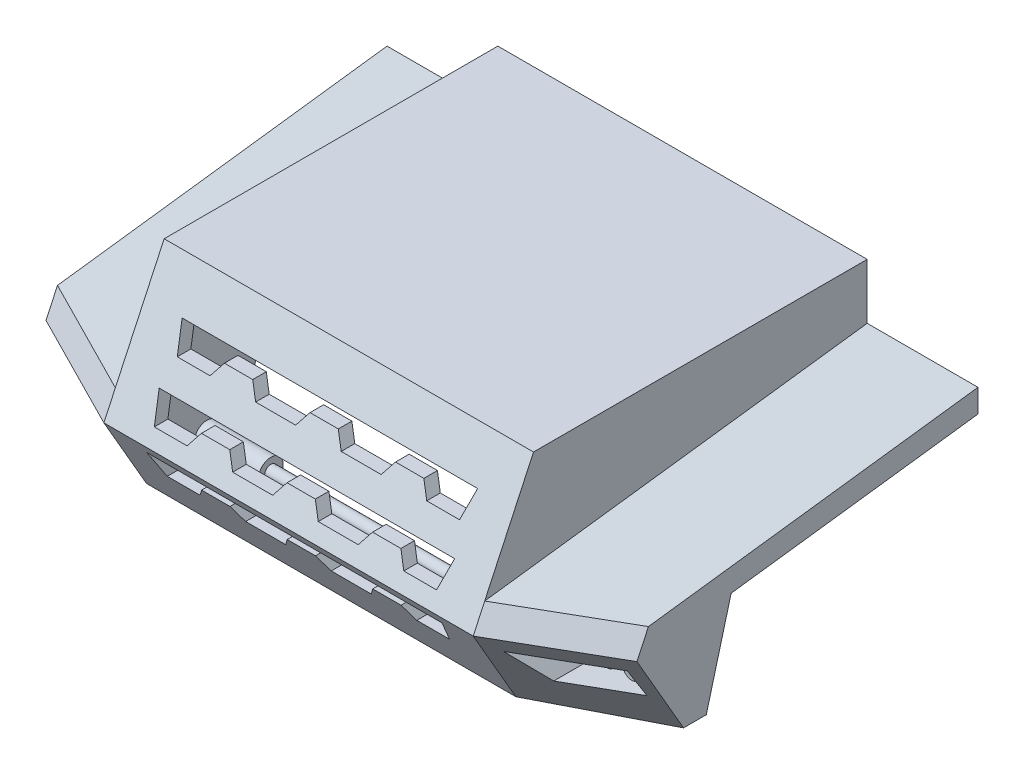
ISO-10303-21;
HEADER;
FILE_DESCRIPTION(('STEP AP214'),'2;1');
FILE_NAME('part.step','',(''),(''),'','','');
FILE_SCHEMA(('AUTOMOTIVE_DESIGN { 1 0 10303 214 1 1 1 1 }'));
ENDSEC;
DATA;
#1=APPLICATION_CONTEXT('core data for automotive mechanical design processes');
#2=APPLICATION_PROTOCOL_DEFINITION('international standard','automotive_design',2000,#1);
#3=PRODUCT_CONTEXT('',#1,'mechanical');
#4=PRODUCT('Part','Part','',(#3));
#5=PRODUCT_RELATED_PRODUCT_CATEGORY('part','',(#4));
#6=PRODUCT_DEFINITION_FORMATION('','',#4);
#7=PRODUCT_DEFINITION_CONTEXT('part definition',#1,'design');
#8=PRODUCT_DEFINITION('design','',#6,#7);
#9=PRODUCT_DEFINITION_SHAPE('','',#8);
#10=(LENGTH_UNIT() NAMED_UNIT(*) SI_UNIT(.MILLI.,.METRE.));
#11=(NAMED_UNIT(*) PLANE_ANGLE_UNIT() SI_UNIT($,.RADIAN.));
#12=(NAMED_UNIT(*) SI_UNIT($,.STERADIAN.) SOLID_ANGLE_UNIT());
#13=UNCERTAINTY_MEASURE_WITH_UNIT(LENGTH_MEASURE(1.E-05),#10,'distance_accuracy_value','');
#14=(GEOMETRIC_REPRESENTATION_CONTEXT(3) GLOBAL_UNCERTAINTY_ASSIGNED_CONTEXT((#13)) GLOBAL_UNIT_ASSIGNED_CONTEXT((#10,
#11,#12)) REPRESENTATION_CONTEXT('',''));
#15=CARTESIAN_POINT('',(0.,0.,0.));
#16=DIRECTION('',(0.,0.,1.));
#17=DIRECTION('',(1.,0.,0.));
#18=AXIS2_PLACEMENT_3D('',#15,#16,#17);
#19=CARTESIAN_POINT('',(-810.,244.7819138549,1200.));
#20=DIRECTION('',(0.784151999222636,-0.62056880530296,0.));
#21=DIRECTION('',(0.62056880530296,0.784151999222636,0.));
#22=AXIS2_PLACEMENT_3D('',#19,#20,#21);
#23=PLANE('',#22);
#24=DIRECTION('',(0.,0.,-1.));
#25=VECTOR('',#24,1.);
#26=CARTESIAN_POINT('',(-878.955154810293,157.650040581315,1300.));
#27=LINE('',#26,#25);
#28=CARTESIAN_POINT('',(-878.955154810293,157.650040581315,1200.));
#29=VERTEX_POINT('',#28);
#30=CARTESIAN_POINT('',(-878.955154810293,157.650040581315,1300.));
#31=VERTEX_POINT('',#30);
#32=EDGE_CURVE('E626',#29,#31,#27,.F.);
#33=ORIENTED_EDGE('',*,*,#32,.F.);
#34=DIRECTION('',(0.62056880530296,0.784151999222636,0.));
#35=VECTOR('',#34,1.);
#36=CARTESIAN_POINT('',(-810.,244.7819138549,1200.));
#37=LINE('',#36,#35);
#38=CARTESIAN_POINT('',(-901.065281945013,129.711639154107,1200.));
#39=VERTEX_POINT('',#38);
#40=EDGE_CURVE('E661',#39,#29,#37,.T.);
#41=ORIENTED_EDGE('',*,*,#40,.F.);
#42=DIRECTION('',(0.,0.,1.));
#43=VECTOR('',#42,1.);
#44=CARTESIAN_POINT('',(-901.065281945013,129.711639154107,1200.));
#45=LINE('',#44,#43);
#46=CARTESIAN_POINT('',(-901.065281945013,129.711639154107,1424.15723018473));
#47=VERTEX_POINT('',#46);
#48=EDGE_CURVE('E674',#39,#47,#45,.T.);
#49=ORIENTED_EDGE('',*,*,#48,.T.);
#50=DIRECTION('',(0.491408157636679,0.62094434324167,0.610693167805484));
#51=VECTOR('',#50,1.);
#52=CARTESIAN_POINT('',(-1150.44311283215,-185.402693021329,1114.24512319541));
#53=LINE('',#52,#51);
#54=CARTESIAN_POINT('',(-810.,244.7819138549,1537.32780874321));
#55=VERTEX_POINT('',#54);
#56=EDGE_CURVE('E1607',#47,#55,#53,.T.);
#57=ORIENTED_EDGE('',*,*,#56,.T.);
#58=DIRECTION('',(0.,0.,1.));
#59=VECTOR('',#58,1.);
#60=CARTESIAN_POINT('',(-810.,244.7819138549,1200.));
#61=LINE('',#60,#59);
#62=CARTESIAN_POINT('',(-810.,244.7819138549,1200.));
#63=VERTEX_POINT('',#62);
#64=EDGE_CURVE('E671',#63,#55,#61,.T.);
#65=ORIENTED_EDGE('',*,*,#64,.F.);
#66=CARTESIAN_POINT('',(-859.199482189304,182.613348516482,1200.));
#67=VERTEX_POINT('',#66);
#68=EDGE_CURVE('E660',#67,#63,#37,.T.);
#69=ORIENTED_EDGE('',*,*,#68,.F.);
#70=DIRECTION('',(0.,0.,-1.));
#71=VECTOR('',#70,1.);
#72=CARTESIAN_POINT('',(-859.199482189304,182.613348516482,1300.));
#73=LINE('',#72,#71);
#74=CARTESIAN_POINT('',(-859.199482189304,182.613348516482,1300.));
#75=VERTEX_POINT('',#74);
#76=EDGE_CURVE('E623',#75,#67,#73,.T.);
#77=ORIENTED_EDGE('',*,*,#76,.F.);
#78=DIRECTION('',(-0.62056880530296,-0.784151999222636,0.));
#79=VECTOR('',#78,1.);
#80=CARTESIAN_POINT('',(-810.,244.7819138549,1300.));
#81=LINE('',#80,#79);
#82=EDGE_CURVE('E118',#75,#31,#81,.T.);
#83=ORIENTED_EDGE('',*,*,#82,.T.);
#84=EDGE_LOOP('',(#33,#41,#49,#57,#65,#69,#77,#83));
#85=FACE_BOUND('',#84,.T.);
#86=ADVANCED_FACE('F95',(#85),#23,.F.);
#87=CARTESIAN_POINT('',(582.299621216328,-655.08707386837,1134.64409532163));
#88=DIRECTION('',(0.40613846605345,-0.456905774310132,0.791384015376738));
#89=DIRECTION('',(0.,-0.866025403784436,-0.500000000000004));
#90=AXIS2_PLACEMENT_3D('',#87,#88,#89);
#91=PLANE('',#90);
#92=DIRECTION('',(-0.900947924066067,-0.055411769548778,0.430374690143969));
#93=VECTOR('',#92,1.);
#94=CARTESIAN_POINT('',(1200.,327.676734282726,1385.03906231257));
#95=LINE('',#94,#93);
#96=CARTESIAN_POINT('',(1200.,327.676734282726,1385.03906231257));
#97=VERTEX_POINT('',#96);
#98=CARTESIAN_POINT('',(750.,300.,1600.));
#99=VERTEX_POINT('',#98);
#100=EDGE_CURVE('E1405',#97,#99,#95,.T.);
#101=ORIENTED_EDGE('',*,*,#100,.T.);
#102=DIRECTION('',(0.,-0.866025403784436,-0.500000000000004));
#103=VECTOR('',#102,1.);
#104=CARTESIAN_POINT('',(750.,-617.820323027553,1070.09618943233));
#105=LINE('',#104,#103);
#106=CARTESIAN_POINT('',(750.,0.,1426.79491924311));
#107=VERTEX_POINT('',#106);
#108=EDGE_CURVE('E1233',#99,#107,#105,.T.);
#109=ORIENTED_EDGE('',*,*,#108,.T.);
#110=DIRECTION('',(-0.889680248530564,0.,0.45658411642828));
#111=VECTOR('',#110,1.);
#112=CARTESIAN_POINT('',(1200.,0.,1195.85481156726));
#113=LINE('',#112,#111);
#114=CARTESIAN_POINT('',(1200.,0.,1195.85481156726));
#115=VERTEX_POINT('',#114);
#116=EDGE_CURVE('E1403',#115,#107,#113,.T.);
#117=ORIENTED_EDGE('',*,*,#116,.F.);
#118=DIRECTION('',(0.,-0.866025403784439,-0.5));
#119=VECTOR('',#118,1.);
#120=CARTESIAN_POINT('',(1200.,327.676734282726,1385.03906231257));
#121=LINE('',#120,#119);
#122=EDGE_CURVE('E1186',#97,#115,#121,.T.);
#123=ORIENTED_EDGE('',*,*,#122,.F.);
#124=EDGE_LOOP('',(#101,#109,#117,#123));
#125=FACE_BOUND('',#124,.T.);
#126=DIRECTION('',(0.900500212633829,0.0528321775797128,-0.431634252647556));
#127=VECTOR('',#126,1.);
#128=CARTESIAN_POINT('',(739.063821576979,240.620101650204,1571.32944908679));
#129=LINE('',#128,#127);
#130=CARTESIAN_POINT('',(810.,244.7819138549,1537.32780874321));
#131=VERTEX_POINT('',#130);
#132=CARTESIAN_POINT('',(1150.,264.729649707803,1374.35655805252));
#133=VERTEX_POINT('',#132);
#134=EDGE_CURVE('E1614',#131,#133,#129,.T.);
#135=ORIENTED_EDGE('',*,*,#134,.T.);
#136=DIRECTION('',(0.0500802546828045,-0.85359495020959,-0.51852447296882));
#137=VECTOR('',#136,1.);
#138=CARTESIAN_POINT('',(1194.12156120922,-487.302105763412,917.527625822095));
#139=LINE('',#138,#137);
#140=CARTESIAN_POINT('',(1157.04037735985,144.729649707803,1301.46140240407));
#141=VERTEX_POINT('',#140);
#142=EDGE_CURVE('E1623',#133,#141,#139,.T.);
#143=ORIENTED_EDGE('',*,*,#142,.T.);
#144=DIRECTION('',(-0.900500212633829,-0.0528321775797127,0.431634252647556));
#145=VECTOR('',#144,1.);
#146=CARTESIAN_POINT('',(717.770818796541,118.957787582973,1512.01525343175));
#147=LINE('',#146,#145);
#148=CARTESIAN_POINT('',(901.065281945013,129.711639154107,1424.15723018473));
#149=VERTEX_POINT('',#148);
#150=EDGE_CURVE('E1620',#141,#149,#147,.T.);
#151=ORIENTED_EDGE('',*,*,#150,.T.);
#152=DIRECTION('',(-0.491408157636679,0.62094434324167,0.610693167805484));
#153=VECTOR('',#152,1.);
#154=CARTESIAN_POINT('',(1150.44311283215,-185.402693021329,1114.24512319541));
#155=LINE('',#154,#153);
#156=EDGE_CURVE('E1617',#149,#131,#155,.T.);
#157=ORIENTED_EDGE('',*,*,#156,.T.);
#158=EDGE_LOOP('',(#135,#143,#151,#157));
#159=FACE_BOUND('',#158,.T.);
#160=ADVANCED_FACE('F1116',(#125,#159),#91,.T.);
#161=CARTESIAN_POINT('',(750.,645.286499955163,1383.82136486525));
#162=DIRECTION('',(0.,-0.422618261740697,-0.906307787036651));
#163=DIRECTION('',(0.,0.906307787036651,-0.422618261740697));
#164=AXIS2_PLACEMENT_3D('',#161,#162,#163);
#165=PLANE('',#164);
#166=DIRECTION('',(0.,-0.906307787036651,0.422618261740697));
#167=VECTOR('',#166,1.);
#168=CARTESIAN_POINT('',(-700.,645.286499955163,1383.82136486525));
#169=LINE('',#168,#167);
#170=CARTESIAN_POINT('',(-700.,775.,1323.33496642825));
#171=VERTEX_POINT('',#170);
#172=CARTESIAN_POINT('',(-700.,302.458785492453,1543.68455354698));
#173=VERTEX_POINT('',#172);
#174=EDGE_CURVE('E1190',#171,#173,#169,.T.);
#175=ORIENTED_EDGE('',*,*,#174,.F.);
#176=DIRECTION('',(-1.,0.,0.));
#177=VECTOR('',#176,1.);
#178=CARTESIAN_POINT('',(750.,775.,1323.33496642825));
#179=LINE('',#178,#177);
#180=CARTESIAN_POINT('',(700.,775.,1323.33496642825));
#181=VERTEX_POINT('',#180);
#182=EDGE_CURVE('E1265',#181,#171,#179,.T.);
#183=ORIENTED_EDGE('',*,*,#182,.F.);
#184=DIRECTION('',(0.,-0.906307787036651,0.422618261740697));
#185=VECTOR('',#184,1.);
#186=CARTESIAN_POINT('',(700.,645.286499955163,1383.82136486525));
#187=LINE('',#186,#185);
#188=CARTESIAN_POINT('',(700.,302.458785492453,1543.68455354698));
#189=VERTEX_POINT('',#188);
#190=EDGE_CURVE('E1207',#181,#189,#187,.T.);
#191=ORIENTED_EDGE('',*,*,#190,.T.);
#192=DIRECTION('',(-1.,0.,0.));
#193=VECTOR('',#192,1.);
#194=CARTESIAN_POINT('',(750.,302.458785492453,1543.68455354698));
#195=LINE('',#194,#193);
#196=EDGE_CURVE('E1228',#189,#173,#195,.T.);
#197=ORIENTED_EDGE('',*,*,#196,.T.);
#198=EDGE_LOOP('',(#175,#183,#191,#197));
#199=FACE_BOUND('',#198,.T.);
#200=DIRECTION('',(1.,0.,0.));
#201=VECTOR('',#200,1.);
#202=CARTESIAN_POINT('',(750.,610.,1400.27573002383));
#203=LINE('',#202,#201);
#204=CARTESIAN_POINT('',(-57.5,610.,1400.27573002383));
#205=VERTEX_POINT('',#204);
#206=CARTESIAN_POINT('',(57.5,610.,1400.27573002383));
#207=VERTEX_POINT('',#206);
#208=EDGE_CURVE('E726',#205,#207,#203,.T.);
#209=ORIENTED_EDGE('',*,*,#208,.T.);
#210=DIRECTION('',(0.535817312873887,-0.765226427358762,0.356830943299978));
#211=VECTOR('',#210,1.);
#212=CARTESIAN_POINT('',(238.702645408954,351.215803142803,1520.94878282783));
#213=LINE('',#212,#211);
#214=CARTESIAN_POINT('',(92.5103769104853,560.,1423.59111293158));
#215=VERTEX_POINT('',#214);
#216=EDGE_CURVE('E816',#207,#215,#213,.T.);
#217=ORIENTED_EDGE('',*,*,#216,.T.);
#218=DIRECTION('',(1.,0.,0.));
#219=VECTOR('',#218,1.);
#220=CARTESIAN_POINT('',(750.,560.,1423.59111293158));
#221=LINE('',#220,#219);
#222=CARTESIAN_POINT('',(254.979246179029,560.,1423.59111293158));
#223=VERTEX_POINT('',#222);
#224=EDGE_CURVE('E813',#215,#223,#221,.T.);
#225=ORIENTED_EDGE('',*,*,#224,.T.);
#226=DIRECTION('',(0.535817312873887,0.765226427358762,-0.356830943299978));
#227=VECTOR('',#226,1.);
#228=CARTESIAN_POINT('',(439.672929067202,823.769915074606,1300.5931815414));
#229=LINE('',#228,#227);
#230=CARTESIAN_POINT('',(289.989623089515,610.,1400.27573002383));
#231=VERTEX_POINT('',#230);
#232=EDGE_CURVE('E810',#223,#231,#229,.T.);
#233=ORIENTED_EDGE('',*,*,#232,.T.);
#234=DIRECTION('',(1.,0.,0.));
#235=VECTOR('',#234,1.);
#236=CARTESIAN_POINT('',(750.,610.,1400.27573002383));
#237=LINE('',#236,#235);
#238=CARTESIAN_POINT('',(404.989623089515,610.,1400.27573002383));
#239=VERTEX_POINT('',#238);
#240=EDGE_CURVE('E807',#231,#239,#237,.T.);
#241=ORIENTED_EDGE('',*,*,#240,.T.);
#242=DIRECTION('',(0.535817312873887,-0.765226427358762,0.356830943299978));
#243=VECTOR('',#242,1.);
#244=CARTESIAN_POINT('',(486.42793072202,493.694043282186,1454.51008833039));
#245=LINE('',#244,#243);
#246=CARTESIAN_POINT('',(440.,560.,1423.59111293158));
#247=VERTEX_POINT('',#246);
#248=EDGE_CURVE('E804',#239,#247,#245,.T.);
#249=ORIENTED_EDGE('',*,*,#248,.T.);
#250=DIRECTION('',(1.,0.,0.));
#251=VECTOR('',#250,1.);
#252=CARTESIAN_POINT('',(750.,560.,1423.59111293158));
#253=LINE('',#252,#251);
#254=CARTESIAN_POINT('',(573.205080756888,560.,1423.59111293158));
#255=VERTEX_POINT('',#254);
#256=EDGE_CURVE('E801',#247,#255,#253,.T.);
#257=ORIENTED_EDGE('',*,*,#256,.T.);
#258=DIRECTION('',(0.235985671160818,0.880710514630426,-0.410682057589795));
#259=VECTOR('',#258,1.);
#260=CARTESIAN_POINT('',(604.630468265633,677.281142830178,1368.9020178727));
#261=LINE('',#260,#259);
#262=CARTESIAN_POINT('',(600.,660.,1376.96034711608));
#263=VERTEX_POINT('',#262);
#264=EDGE_CURVE('E798',#255,#263,#261,.T.);
#265=ORIENTED_EDGE('',*,*,#264,.T.);
#266=DIRECTION('',(-1.,0.,0.));
#267=VECTOR('',#266,1.);
#268=CARTESIAN_POINT('',(750.,660.,1376.96034711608));
#269=LINE('',#268,#267);
#270=CARTESIAN_POINT('',(-600.,660.,1376.96034711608));
#271=VERTEX_POINT('',#270);
#272=EDGE_CURVE('E795',#263,#271,#269,.T.);
#273=ORIENTED_EDGE('',*,*,#272,.T.);
#274=DIRECTION('',(0.235985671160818,-0.880710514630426,0.410682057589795));
#275=VECTOR('',#274,1.);
#276=CARTESIAN_POINT('',(-521.0966127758,365.528549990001,1514.27463936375));
#277=LINE('',#276,#275);
#278=CARTESIAN_POINT('',(-573.205080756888,560.,1423.59111293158));
#279=VERTEX_POINT('',#278);
#280=EDGE_CURVE('E792',#271,#279,#277,.T.);
#281=ORIENTED_EDGE('',*,*,#280,.T.);
#282=DIRECTION('',(1.,0.,0.));
#283=VECTOR('',#282,1.);
#284=CARTESIAN_POINT('',(750.,560.,1423.59111293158));
#285=LINE('',#284,#283);
#286=CARTESIAN_POINT('',(-440.,560.,1423.59111293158));
#287=VERTEX_POINT('',#286);
#288=EDGE_CURVE('E789',#279,#287,#285,.T.);
#289=ORIENTED_EDGE('',*,*,#288,.T.);
#290=DIRECTION('',(0.535817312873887,0.765226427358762,-0.356830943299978));
#291=VECTOR('',#290,1.);
#292=CARTESIAN_POINT('',(-55.7776415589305,1108.72639535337,1167.71579254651));
#293=LINE('',#292,#291);
#294=CARTESIAN_POINT('',(-404.989623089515,610.,1400.27573002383));
#295=VERTEX_POINT('',#294);
#296=EDGE_CURVE('E786',#287,#295,#293,.T.);
#297=ORIENTED_EDGE('',*,*,#296,.T.);
#298=DIRECTION('',(1.,0.,0.));
#299=VECTOR('',#298,1.);
#300=CARTESIAN_POINT('',(750.,610.,1400.27573002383));
#301=LINE('',#300,#299);
#302=CARTESIAN_POINT('',(-289.989623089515,610.,1400.27573002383));
#303=VERTEX_POINT('',#302);
#304=EDGE_CURVE('E783',#295,#303,#301,.T.);
#305=ORIENTED_EDGE('',*,*,#304,.T.);
#306=DIRECTION('',(0.535817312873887,-0.765226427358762,0.356830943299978));
#307=VECTOR('',#306,1.);
#308=CARTESIAN_POINT('',(-9.02263990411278,208.737563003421,1587.38747732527));
#309=LINE('',#308,#307);
#310=CARTESIAN_POINT('',(-254.979246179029,560.,1423.59111293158));
#311=VERTEX_POINT('',#310);
#312=EDGE_CURVE('E780',#303,#311,#309,.T.);
#313=ORIENTED_EDGE('',*,*,#312,.T.);
#314=DIRECTION('',(1.,0.,0.));
#315=VECTOR('',#314,1.);
#316=CARTESIAN_POINT('',(750.,560.,1423.59111293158));
#317=LINE('',#316,#315);
#318=CARTESIAN_POINT('',(-92.5103769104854,560.,1423.59111293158));
#319=VERTEX_POINT('',#318);
#320=EDGE_CURVE('E777',#311,#319,#317,.T.);
#321=ORIENTED_EDGE('',*,*,#320,.T.);
#322=DIRECTION('',(0.535817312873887,0.765226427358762,-0.356830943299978));
#323=VECTOR('',#322,1.);
#324=CARTESIAN_POINT('',(191.947643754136,966.248155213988,1234.15448704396));
#325=LINE('',#324,#323);
#326=EDGE_CURVE('E774',#319,#205,#325,.T.);
#327=ORIENTED_EDGE('',*,*,#326,.T.);
#328=EDGE_LOOP('',(#209,#217,#225,#233,#241,#249,#257,#265,#273,#281,#289,#297,#305,#313,#321,#327));
#329=FACE_BOUND('',#328,.T.);
#330=DIRECTION('',(1.,0.,0.));
#331=VECTOR('',#330,1.);
#332=CARTESIAN_POINT('',(750.,410.,1493.53726165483));
#333=LINE('',#332,#331);
#334=CARTESIAN_POINT('',(-57.5,410.,1493.53726165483));
#335=VERTEX_POINT('',#334);
#336=CARTESIAN_POINT('',(57.5,410.,1493.53726165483));
#337=VERTEX_POINT('',#336);
#338=EDGE_CURVE('E819',#335,#337,#333,.T.);
#339=ORIENTED_EDGE('',*,*,#338,.T.);
#340=DIRECTION('',(0.535817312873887,-0.765226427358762,0.356830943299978));
#341=VECTOR('',#340,1.);
#342=CARTESIAN_POINT('',(138.86708160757,293.795764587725,1547.72418653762));
#343=LINE('',#342,#341);
#344=CARTESIAN_POINT('',(92.5103769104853,360.,1516.85264456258));
#345=VERTEX_POINT('',#344);
#346=EDGE_CURVE('E864',#337,#345,#343,.T.);
#347=ORIENTED_EDGE('',*,*,#346,.T.);
#348=DIRECTION('',(1.,0.,0.));
#349=VECTOR('',#348,1.);
#350=CARTESIAN_POINT('',(750.,360.,1516.85264456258));
#351=LINE('',#350,#349);
#352=CARTESIAN_POINT('',(254.979246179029,360.,1516.85264456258));
#353=VERTEX_POINT('',#352);
#354=EDGE_CURVE('E861',#345,#353,#351,.T.);
#355=ORIENTED_EDGE('',*,*,#354,.T.);
#356=DIRECTION('',(0.535817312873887,0.765226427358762,-0.356830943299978));
#357=VECTOR('',#356,1.);
#358=CARTESIAN_POINT('',(539.508492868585,766.349876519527,1327.36858525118));
#359=LINE('',#358,#357);
#360=CARTESIAN_POINT('',(289.989623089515,410.,1493.53726165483));
#361=VERTEX_POINT('',#360);
#362=EDGE_CURVE('E858',#353,#361,#359,.T.);
#363=ORIENTED_EDGE('',*,*,#362,.T.);
#364=DIRECTION('',(1.,0.,0.));
#365=VECTOR('',#364,1.);
#366=CARTESIAN_POINT('',(750.,410.,1493.53726165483));
#367=LINE('',#366,#365);
#368=CARTESIAN_POINT('',(404.989623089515,410.,1493.53726165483));
#369=VERTEX_POINT('',#368);
#370=EDGE_CURVE('E855',#361,#369,#367,.T.);
#371=ORIENTED_EDGE('',*,*,#370,.T.);
#372=DIRECTION('',(0.535817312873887,-0.765226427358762,0.356830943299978));
#373=VECTOR('',#372,1.);
#374=CARTESIAN_POINT('',(386.592366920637,436.274004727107,1481.28549204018));
#375=LINE('',#374,#373);
#376=CARTESIAN_POINT('',(440.,360.,1516.85264456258));
#377=VERTEX_POINT('',#376);
#378=EDGE_CURVE('E852',#369,#377,#375,.T.);
#379=ORIENTED_EDGE('',*,*,#378,.T.);
#380=DIRECTION('',(1.,0.,0.));
#381=VECTOR('',#380,1.);
#382=CARTESIAN_POINT('',(750.,360.,1516.85264456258));
#383=LINE('',#382,#381);
#384=CARTESIAN_POINT('',(573.205080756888,360.,1516.85264456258));
#385=VERTEX_POINT('',#384);
#386=EDGE_CURVE('E849',#377,#385,#383,.T.);
#387=ORIENTED_EDGE('',*,*,#386,.T.);
#388=DIRECTION('',(0.235985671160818,0.880710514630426,-0.410682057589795));
#389=VECTOR('',#388,1.);
#390=CARTESIAN_POINT('',(655.235929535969,666.143295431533,1374.09568141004));
#391=LINE('',#390,#389);
#392=CARTESIAN_POINT('',(600.,460.,1470.22187874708));
#393=VERTEX_POINT('',#392);
#394=EDGE_CURVE('E846',#385,#393,#391,.T.);
#395=ORIENTED_EDGE('',*,*,#394,.T.);
#396=DIRECTION('',(-1.,0.,0.));
#397=VECTOR('',#396,1.);
#398=CARTESIAN_POINT('',(750.,460.,1470.22187874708));
#399=LINE('',#398,#397);
#400=CARTESIAN_POINT('',(-600.,460.,1470.22187874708));
#401=VERTEX_POINT('',#400);
#402=EDGE_CURVE('E843',#393,#401,#399,.T.);
#403=ORIENTED_EDGE('',*,*,#402,.T.);
#404=DIRECTION('',(0.235985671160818,-0.880710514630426,0.410682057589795));
#405=VECTOR('',#404,1.);
#406=CARTESIAN_POINT('',(-571.702074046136,354.390702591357,1519.4683029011));
#407=LINE('',#406,#405);
#408=CARTESIAN_POINT('',(-573.205080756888,360.,1516.85264456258));
#409=VERTEX_POINT('',#408);
#410=EDGE_CURVE('E840',#401,#409,#407,.T.);
#411=ORIENTED_EDGE('',*,*,#410,.T.);
#412=DIRECTION('',(1.,0.,0.));
#413=VECTOR('',#412,1.);
#414=CARTESIAN_POINT('',(750.,360.,1516.85264456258));
#415=LINE('',#414,#413);
#416=CARTESIAN_POINT('',(-440.,360.,1516.85264456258));
#417=VERTEX_POINT('',#416);
#418=EDGE_CURVE('E837',#409,#417,#415,.T.);
#419=ORIENTED_EDGE('',*,*,#418,.T.);
#420=DIRECTION('',(0.535817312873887,0.765226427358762,-0.356830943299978));
#421=VECTOR('',#420,1.);
#422=CARTESIAN_POINT('',(44.0579222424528,1051.30635679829,1194.4911962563));
#423=LINE('',#422,#421);
#424=CARTESIAN_POINT('',(-404.989623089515,410.,1493.53726165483));
#425=VERTEX_POINT('',#424);
#426=EDGE_CURVE('E834',#417,#425,#423,.T.);
#427=ORIENTED_EDGE('',*,*,#426,.T.);
#428=DIRECTION('',(1.,0.,0.));
#429=VECTOR('',#428,1.);
#430=CARTESIAN_POINT('',(750.,410.,1493.53726165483));
#431=LINE('',#430,#429);
#432=CARTESIAN_POINT('',(-289.989623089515,410.,1493.53726165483));
#433=VERTEX_POINT('',#432);
#434=EDGE_CURVE('E831',#425,#433,#431,.T.);
#435=ORIENTED_EDGE('',*,*,#434,.T.);
#436=DIRECTION('',(0.535817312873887,-0.765226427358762,0.356830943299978));
#437=VECTOR('',#436,1.);
#438=CARTESIAN_POINT('',(-108.858203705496,151.317524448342,1614.16288103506));
#439=LINE('',#438,#437);
#440=CARTESIAN_POINT('',(-254.979246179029,360.,1516.85264456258));
#441=VERTEX_POINT('',#440);
#442=EDGE_CURVE('E828',#433,#441,#439,.T.);
#443=ORIENTED_EDGE('',*,*,#442,.T.);
#444=DIRECTION('',(1.,0.,0.));
#445=VECTOR('',#444,1.);
#446=CARTESIAN_POINT('',(750.,360.,1516.85264456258));
#447=LINE('',#446,#445);
#448=CARTESIAN_POINT('',(-92.5103769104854,360.,1516.85264456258));
#449=VERTEX_POINT('',#448);
#450=EDGE_CURVE('E825',#441,#449,#447,.T.);
#451=ORIENTED_EDGE('',*,*,#450,.T.);
#452=DIRECTION('',(0.535817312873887,0.765226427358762,-0.356830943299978));
#453=VECTOR('',#452,1.);
#454=CARTESIAN_POINT('',(291.783207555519,908.82811665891,1260.92989075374));
#455=LINE('',#454,#453);
#456=EDGE_CURVE('E822',#449,#335,#455,.T.);
#457=ORIENTED_EDGE('',*,*,#456,.T.);
#458=EDGE_LOOP('',(#339,#347,#355,#363,#371,#379,#387,#395,#403,#411,#419,#427,#435,#443,#451,#457));
#459=FACE_BOUND('',#458,.T.);
#460=ADVANCED_FACE('F1120',(#199,#329,#459),#165,.T.);
#461=CARTESIAN_POINT('',(750.,666.417413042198,1429.13675421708));
#462=DIRECTION('',(0.,-0.422618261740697,-0.906307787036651));
#463=DIRECTION('',(0.,0.906307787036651,-0.422618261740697));
#464=AXIS2_PLACEMENT_3D('',#461,#462,#463);
#465=PLANE('',#464);
#466=DIRECTION('',(0.535817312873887,-0.765226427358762,0.356830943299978));
#467=VECTOR('',#466,1.);
#468=CARTESIAN_POINT('',(228.154562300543,366.28002700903,1569.09311582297));
#469=LINE('',#468,#467);
#470=CARTESIAN_POINT('',(57.5,610.,1455.44462597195));
#471=VERTEX_POINT('',#470);
#472=CARTESIAN_POINT('',(92.5103769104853,560.,1478.7600088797));
#473=VERTEX_POINT('',#472);
#474=EDGE_CURVE('E1570',#471,#473,#469,.T.);
#475=ORIENTED_EDGE('',*,*,#474,.F.);
#476=DIRECTION('',(1.,0.,0.));
#477=VECTOR('',#476,1.);
#478=CARTESIAN_POINT('',(750.,610.,1455.44462597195));
#479=LINE('',#478,#477);
#480=CARTESIAN_POINT('',(-57.5,610.,1455.44462597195));
#481=VERTEX_POINT('',#480);
#482=EDGE_CURVE('E1539',#481,#471,#479,.T.);
#483=ORIENTED_EDGE('',*,*,#482,.F.);
#484=DIRECTION('',(0.535817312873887,0.765226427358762,-0.356830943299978));
#485=VECTOR('',#484,1.);
#486=CARTESIAN_POINT('',(202.495726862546,981.312379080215,1282.2988200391));
#487=LINE('',#486,#485);
#488=CARTESIAN_POINT('',(-92.5103769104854,560.,1478.7600088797));
#489=VERTEX_POINT('',#488);
#490=EDGE_CURVE('E1541',#489,#481,#487,.T.);
#491=ORIENTED_EDGE('',*,*,#490,.F.);
#492=DIRECTION('',(1.,0.,0.));
#493=VECTOR('',#492,1.);
#494=CARTESIAN_POINT('',(750.,560.,1478.7600088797));
#495=LINE('',#494,#493);
#496=CARTESIAN_POINT('',(-254.979246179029,560.,1478.7600088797));
#497=VERTEX_POINT('',#496);
#498=EDGE_CURVE('E1544',#497,#489,#495,.T.);
#499=ORIENTED_EDGE('',*,*,#498,.F.);
#500=DIRECTION('',(0.535817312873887,-0.765226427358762,0.356830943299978));
#501=VECTOR('',#500,1.);
#502=CARTESIAN_POINT('',(-19.5707230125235,223.801786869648,1635.53181032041));
#503=LINE('',#502,#501);
#504=CARTESIAN_POINT('',(-289.989623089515,610.,1455.44462597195));
#505=VERTEX_POINT('',#504);
#506=EDGE_CURVE('E1546',#505,#497,#503,.T.);
#507=ORIENTED_EDGE('',*,*,#506,.F.);
#508=DIRECTION('',(1.,0.,0.));
#509=VECTOR('',#508,1.);
#510=CARTESIAN_POINT('',(750.,610.,1455.44462597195));
#511=LINE('',#510,#509);
#512=CARTESIAN_POINT('',(-404.989623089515,610.,1455.44462597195));
#513=VERTEX_POINT('',#512);
#514=EDGE_CURVE('E1548',#513,#505,#511,.T.);
#515=ORIENTED_EDGE('',*,*,#514,.F.);
#516=DIRECTION('',(0.535817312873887,0.765226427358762,-0.356830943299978));
#517=VECTOR('',#516,1.);
#518=CARTESIAN_POINT('',(-45.2295584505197,1123.7906192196,1215.86012554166));
#519=LINE('',#518,#517);
#520=CARTESIAN_POINT('',(-440.,560.,1478.7600088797));
#521=VERTEX_POINT('',#520);
#522=EDGE_CURVE('E1550',#521,#513,#519,.T.);
#523=ORIENTED_EDGE('',*,*,#522,.F.);
#524=DIRECTION('',(1.,0.,0.));
#525=VECTOR('',#524,1.);
#526=CARTESIAN_POINT('',(750.,560.,1478.7600088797));
#527=LINE('',#526,#525);
#528=CARTESIAN_POINT('',(-573.205080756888,560.,1478.7600088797));
#529=VERTEX_POINT('',#528);
#530=EDGE_CURVE('E1552',#529,#521,#527,.T.);
#531=ORIENTED_EDGE('',*,*,#530,.F.);
#532=DIRECTION('',(0.235985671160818,-0.880710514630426,0.410682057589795));
#533=VECTOR('',#532,1.);
#534=CARTESIAN_POINT('',(-526.443310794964,385.482698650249,1560.13876297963));
#535=LINE('',#534,#533);
#536=CARTESIAN_POINT('',(-600.,660.,1432.1292430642));
#537=VERTEX_POINT('',#536);
#538=EDGE_CURVE('E1554',#537,#529,#535,.T.);
#539=ORIENTED_EDGE('',*,*,#538,.F.);
#540=DIRECTION('',(-1.,0.,0.));
#541=VECTOR('',#540,1.);
#542=CARTESIAN_POINT('',(750.,660.,1432.1292430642));
#543=LINE('',#542,#541);
#544=CARTESIAN_POINT('',(600.,660.,1432.1292430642));
#545=VERTEX_POINT('',#544);
#546=EDGE_CURVE('E1556',#545,#537,#543,.T.);
#547=ORIENTED_EDGE('',*,*,#546,.F.);
#548=DIRECTION('',(0.235985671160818,0.880710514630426,-0.410682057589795));
#549=VECTOR('',#548,1.);
#550=CARTESIAN_POINT('',(609.977166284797,697.235291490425,1414.76614148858));
#551=LINE('',#550,#549);
#552=CARTESIAN_POINT('',(573.205080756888,560.,1478.7600088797));
#553=VERTEX_POINT('',#552);
#554=EDGE_CURVE('E1558',#553,#545,#551,.T.);
#555=ORIENTED_EDGE('',*,*,#554,.F.);
#556=DIRECTION('',(1.,0.,0.));
#557=VECTOR('',#556,1.);
#558=CARTESIAN_POINT('',(750.,560.,1478.7600088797));
#559=LINE('',#558,#557);
#560=CARTESIAN_POINT('',(440.,560.,1478.7600088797));
#561=VERTEX_POINT('',#560);
#562=EDGE_CURVE('E1560',#561,#553,#559,.T.);
#563=ORIENTED_EDGE('',*,*,#562,.F.);
#564=DIRECTION('',(0.535817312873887,-0.765226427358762,0.356830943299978));
#565=VECTOR('',#564,1.);
#566=CARTESIAN_POINT('',(475.879847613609,508.758267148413,1502.65442132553));
#567=LINE('',#566,#565);
#568=CARTESIAN_POINT('',(404.989623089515,610.,1455.44462597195));
#569=VERTEX_POINT('',#568);
#570=EDGE_CURVE('E1562',#569,#561,#567,.T.);
#571=ORIENTED_EDGE('',*,*,#570,.F.);
#572=DIRECTION('',(1.,0.,0.));
#573=VECTOR('',#572,1.);
#574=CARTESIAN_POINT('',(750.,610.,1455.44462597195));
#575=LINE('',#574,#573);
#576=CARTESIAN_POINT('',(289.989623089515,610.,1455.44462597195));
#577=VERTEX_POINT('',#576);
#578=EDGE_CURVE('E1564',#577,#569,#575,.T.);
#579=ORIENTED_EDGE('',*,*,#578,.F.);
#580=DIRECTION('',(0.535817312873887,0.765226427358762,-0.356830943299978));
#581=VECTOR('',#580,1.);
#582=CARTESIAN_POINT('',(450.221012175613,838.834138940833,1348.73751453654));
#583=LINE('',#582,#581);
#584=CARTESIAN_POINT('',(254.979246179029,560.,1478.7600088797));
#585=VERTEX_POINT('',#584);
#586=EDGE_CURVE('E1566',#585,#577,#583,.T.);
#587=ORIENTED_EDGE('',*,*,#586,.F.);
#588=DIRECTION('',(1.,0.,0.));
#589=VECTOR('',#588,1.);
#590=CARTESIAN_POINT('',(750.,560.,1478.7600088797));
#591=LINE('',#590,#589);
#592=EDGE_CURVE('E1568',#473,#585,#591,.T.);
#593=ORIENTED_EDGE('',*,*,#592,.F.);
#594=EDGE_LOOP('',(#475,#483,#491,#499,#507,#515,#523,#531,#539,#547,#555,#563,#571,#579,#587,#593));
#595=FACE_BOUND('',#594,.T.);
#596=DIRECTION('',(0.,-0.906307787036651,0.422618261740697));
#597=VECTOR('',#596,1.);
#598=CARTESIAN_POINT('',(-750.,666.417413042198,1429.13675421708));
#599=LINE('',#598,#597);
#600=CARTESIAN_POINT('',(-750.,825.,1355.18847946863));
#601=VERTEX_POINT('',#600);
#602=CARTESIAN_POINT('',(-750.,400.,1553.3692341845));
#603=VERTEX_POINT('',#602);
#604=EDGE_CURVE('E1247',#601,#603,#599,.T.);
#605=ORIENTED_EDGE('',*,*,#604,.T.);
#606=CARTESIAN_POINT('',(-750.,400.,1553.3692341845));
#607=DIRECTION('',(0.,-0.906307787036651,0.422618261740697));
#608=VECTOR('',#607,1.);
#609=LINE('',#606,#608);
#610=CARTESIAN_POINT('',(-750.,300.,1600.));
#611=VERTEX_POINT('',#610);
#612=EDGE_CURVE('E1387',#603,#611,#609,.T.);
#613=ORIENTED_EDGE('',*,*,#612,.T.);
#614=DIRECTION('',(-1.,0.,0.));
#615=VECTOR('',#614,1.);
#616=CARTESIAN_POINT('',(750.,300.,1600.));
#617=LINE('',#616,#615);
#618=EDGE_CURVE('E1234',#99,#611,#617,.T.);
#619=ORIENTED_EDGE('',*,*,#618,.F.);
#620=DIRECTION('',(0.,-0.906307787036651,0.422618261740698));
#621=VECTOR('',#620,1.);
#622=CARTESIAN_POINT('',(750.,300.,1600.));
#623=LINE('',#622,#621);
#624=CARTESIAN_POINT('',(750.,400.,1553.3692341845));
#625=VERTEX_POINT('',#624);
#626=EDGE_CURVE('E1408',#625,#99,#623,.T.);
#627=ORIENTED_EDGE('',*,*,#626,.F.);
#628=DIRECTION('',(0.,-0.906307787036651,0.422618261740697));
#629=VECTOR('',#628,1.);
#630=CARTESIAN_POINT('',(750.,666.417413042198,1429.13675421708));
#631=LINE('',#630,#629);
#632=CARTESIAN_POINT('',(750.,825.,1355.18847946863));
#633=VERTEX_POINT('',#632);
#634=EDGE_CURVE('E1230',#633,#625,#631,.T.);
#635=ORIENTED_EDGE('',*,*,#634,.F.);
#636=DIRECTION('',(-1.,0.,0.));
#637=VECTOR('',#636,1.);
#638=CARTESIAN_POINT('',(750.,825.,1355.18847946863));
#639=LINE('',#638,#637);
#640=EDGE_CURVE('E1257',#633,#601,#639,.T.);
#641=ORIENTED_EDGE('',*,*,#640,.T.);
#642=EDGE_LOOP('',(#605,#613,#619,#627,#635,#641));
#643=FACE_BOUND('',#642,.T.);
#644=DIRECTION('',(0.535817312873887,-0.765226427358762,0.356830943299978));
#645=VECTOR('',#644,1.);
#646=CARTESIAN_POINT('',(128.31899849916,308.859988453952,1595.86851953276));
#647=LINE('',#646,#645);
#648=CARTESIAN_POINT('',(57.5,410.,1548.70615760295));
#649=VERTEX_POINT('',#648);
#650=CARTESIAN_POINT('',(92.5103769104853,360.,1572.0215405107));
#651=VERTEX_POINT('',#650);
#652=EDGE_CURVE('E1603',#649,#651,#647,.T.);
#653=ORIENTED_EDGE('',*,*,#652,.F.);
#654=DIRECTION('',(1.,0.,0.));
#655=VECTOR('',#654,1.);
#656=CARTESIAN_POINT('',(750.,410.,1548.70615760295));
#657=LINE('',#656,#655);
#658=CARTESIAN_POINT('',(-57.5,410.,1548.70615760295));
#659=VERTEX_POINT('',#658);
#660=EDGE_CURVE('E1572',#659,#649,#657,.T.);
#661=ORIENTED_EDGE('',*,*,#660,.F.);
#662=DIRECTION('',(0.535817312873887,0.765226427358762,-0.356830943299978));
#663=VECTOR('',#662,1.);
#664=CARTESIAN_POINT('',(302.33129066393,923.892340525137,1309.07422374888));
#665=LINE('',#664,#663);
#666=CARTESIAN_POINT('',(-92.5103769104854,360.,1572.0215405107));
#667=VERTEX_POINT('',#666);
#668=EDGE_CURVE('E1574',#667,#659,#665,.T.);
#669=ORIENTED_EDGE('',*,*,#668,.F.);
#670=DIRECTION('',(1.,0.,0.));
#671=VECTOR('',#670,1.);
#672=CARTESIAN_POINT('',(750.,360.,1572.0215405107));
#673=LINE('',#672,#671);
#674=CARTESIAN_POINT('',(-254.979246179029,360.,1572.0215405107));
#675=VERTEX_POINT('',#674);
#676=EDGE_CURVE('E1577',#675,#667,#673,.T.);
#677=ORIENTED_EDGE('',*,*,#676,.F.);
#678=DIRECTION('',(0.535817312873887,-0.765226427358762,0.356830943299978));
#679=VECTOR('',#678,1.);
#680=CARTESIAN_POINT('',(-119.406286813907,166.381748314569,1662.3072140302));
#681=LINE('',#680,#679);
#682=CARTESIAN_POINT('',(-289.989623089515,410.,1548.70615760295));
#683=VERTEX_POINT('',#682);
#684=EDGE_CURVE('E1579',#683,#675,#681,.T.);
#685=ORIENTED_EDGE('',*,*,#684,.F.);
#686=DIRECTION('',(1.,0.,0.));
#687=VECTOR('',#686,1.);
#688=CARTESIAN_POINT('',(750.,410.,1548.70615760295));
#689=LINE('',#688,#687);
#690=CARTESIAN_POINT('',(-404.989623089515,410.,1548.70615760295));
#691=VERTEX_POINT('',#690);
#692=EDGE_CURVE('E1581',#691,#683,#689,.T.);
#693=ORIENTED_EDGE('',*,*,#692,.F.);
#694=DIRECTION('',(0.535817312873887,0.765226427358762,-0.356830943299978));
#695=VECTOR('',#694,1.);
#696=CARTESIAN_POINT('',(54.6060053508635,1066.37058066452,1242.63552925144));
#697=LINE('',#696,#695);
#698=CARTESIAN_POINT('',(-440.,360.,1572.0215405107));
#699=VERTEX_POINT('',#698);
#700=EDGE_CURVE('E1583',#699,#691,#697,.T.);
#701=ORIENTED_EDGE('',*,*,#700,.F.);
#702=DIRECTION('',(1.,0.,0.));
#703=VECTOR('',#702,1.);
#704=CARTESIAN_POINT('',(750.,360.,1572.0215405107));
#705=LINE('',#704,#703);
#706=CARTESIAN_POINT('',(-573.205080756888,360.,1572.0215405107));
#707=VERTEX_POINT('',#706);
#708=EDGE_CURVE('E1585',#707,#699,#705,.T.);
#709=ORIENTED_EDGE('',*,*,#708,.F.);
#710=DIRECTION('',(0.235985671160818,-0.880710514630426,0.410682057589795));
#711=VECTOR('',#710,1.);
#712=CARTESIAN_POINT('',(-577.0487720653,374.344851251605,1565.33242651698));
#713=LINE('',#712,#711);
#714=CARTESIAN_POINT('',(-600.,460.,1525.3907746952));
#715=VERTEX_POINT('',#714);
#716=EDGE_CURVE('E1587',#715,#707,#713,.T.);
#717=ORIENTED_EDGE('',*,*,#716,.F.);
#718=DIRECTION('',(-1.,0.,0.));
#719=VECTOR('',#718,1.);
#720=CARTESIAN_POINT('',(750.,460.,1525.3907746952));
#721=LINE('',#720,#719);
#722=CARTESIAN_POINT('',(600.,460.,1525.3907746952));
#723=VERTEX_POINT('',#722);
#724=EDGE_CURVE('E1589',#723,#715,#721,.T.);
#725=ORIENTED_EDGE('',*,*,#724,.F.);
#726=DIRECTION('',(0.235985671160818,0.880710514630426,-0.410682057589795));
#727=VECTOR('',#726,1.);
#728=CARTESIAN_POINT('',(660.582627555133,686.097444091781,1419.95980502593));
#729=LINE('',#728,#727);
#730=CARTESIAN_POINT('',(573.205080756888,360.,1572.0215405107));
#731=VERTEX_POINT('',#730);
#732=EDGE_CURVE('E1591',#731,#723,#729,.T.);
#733=ORIENTED_EDGE('',*,*,#732,.F.);
#734=DIRECTION('',(1.,0.,0.));
#735=VECTOR('',#734,1.);
#736=CARTESIAN_POINT('',(750.,360.,1572.0215405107));
#737=LINE('',#736,#735);
#738=CARTESIAN_POINT('',(440.,360.,1572.0215405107));
#739=VERTEX_POINT('',#738);
#740=EDGE_CURVE('E1593',#739,#731,#737,.T.);
#741=ORIENTED_EDGE('',*,*,#740,.F.);
#742=DIRECTION('',(0.535817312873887,-0.765226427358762,0.356830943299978));
#743=VECTOR('',#742,1.);
#744=CARTESIAN_POINT('',(376.044283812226,451.338228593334,1529.42982503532));
#745=LINE('',#744,#743);
#746=CARTESIAN_POINT('',(404.989623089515,410.,1548.70615760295));
#747=VERTEX_POINT('',#746);
#748=EDGE_CURVE('E1595',#747,#739,#745,.T.);
#749=ORIENTED_EDGE('',*,*,#748,.F.);
#750=DIRECTION('',(1.,0.,0.));
#751=VECTOR('',#750,1.);
#752=CARTESIAN_POINT('',(750.,410.,1548.70615760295));
#753=LINE('',#752,#751);
#754=CARTESIAN_POINT('',(289.989623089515,410.,1548.70615760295));
#755=VERTEX_POINT('',#754);
#756=EDGE_CURVE('E1597',#755,#747,#753,.T.);
#757=ORIENTED_EDGE('',*,*,#756,.F.);
#758=DIRECTION('',(0.535817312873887,0.765226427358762,-0.356830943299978));
#759=VECTOR('',#758,1.);
#760=CARTESIAN_POINT('',(550.056575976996,781.414100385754,1375.51291824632));
#761=LINE('',#760,#759);
#762=CARTESIAN_POINT('',(254.979246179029,360.,1572.0215405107));
#763=VERTEX_POINT('',#762);
#764=EDGE_CURVE('E1599',#763,#755,#761,.T.);
#765=ORIENTED_EDGE('',*,*,#764,.F.);
#766=DIRECTION('',(1.,0.,0.));
#767=VECTOR('',#766,1.);
#768=CARTESIAN_POINT('',(750.,360.,1572.0215405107));
#769=LINE('',#768,#767);
#770=EDGE_CURVE('E1601',#651,#763,#769,.T.);
#771=ORIENTED_EDGE('',*,*,#770,.F.);
#772=EDGE_LOOP('',(#653,#661,#669,#677,#685,#693,#701,#709,#717,#725,#733,#741,#749,#757,#765,#771));
#773=FACE_BOUND('',#772,.T.);
#774=ADVANCED_FACE('F1389',(#595,#643,#773),#465,.F.);
#775=CARTESIAN_POINT('',(750.,-592.820323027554,1026.7949192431));
#776=DIRECTION('',(0.,0.500000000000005,-0.866025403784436));
#777=DIRECTION('',(0.,0.866025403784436,0.500000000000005));
#778=AXIS2_PLACEMENT_3D('',#775,#776,#777);
#779=PLANE('',#778);
#780=DIRECTION('',(0.,-0.866025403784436,-0.500000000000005));
#781=VECTOR('',#780,1.);
#782=CARTESIAN_POINT('',(-700.,-592.820323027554,1026.7949192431));
#783=LINE('',#782,#781);
#784=CARTESIAN_POINT('',(-700.,0.,1369.05989232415));
#785=VERTEX_POINT('',#784);
#786=EDGE_CURVE('E1197',#173,#785,#783,.T.);
#787=ORIENTED_EDGE('',*,*,#786,.F.);
#788=ORIENTED_EDGE('',*,*,#196,.F.);
#789=DIRECTION('',(0.,-0.866025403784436,-0.500000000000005));
#790=VECTOR('',#789,1.);
#791=CARTESIAN_POINT('',(700.,-592.820323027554,1026.7949192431));
#792=LINE('',#791,#790);
#793=CARTESIAN_POINT('',(700.,0.,1369.05989232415));
#794=VERTEX_POINT('',#793);
#795=EDGE_CURVE('E1209',#189,#794,#792,.T.);
#796=ORIENTED_EDGE('',*,*,#795,.T.);
#797=DIRECTION('',(-1.,0.,0.));
#798=VECTOR('',#797,1.);
#799=CARTESIAN_POINT('',(750.,0.,1369.05989232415));
#800=LINE('',#799,#798);
#801=EDGE_CURVE('E1254',#794,#785,#800,.T.);
#802=ORIENTED_EDGE('',*,*,#801,.T.);
#803=EDGE_LOOP('',(#787,#788,#796,#802));
#804=FACE_BOUND('',#803,.T.);
#805=DIRECTION('',(1.,0.,0.));
#806=VECTOR('',#805,1.);
#807=CARTESIAN_POINT('',(750.,210.,1490.30344885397));
#808=LINE('',#807,#806);
#809=CARTESIAN_POINT('',(-57.5,210.,1490.30344885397));
#810=VERTEX_POINT('',#809);
#811=CARTESIAN_POINT('',(57.5,210.,1490.30344885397));
#812=VERTEX_POINT('',#811);
#813=EDGE_CURVE('E914',#810,#812,#808,.T.);
#814=ORIENTED_EDGE('',*,*,#813,.T.);
#815=DIRECTION('',(0.518512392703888,-0.740512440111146,-0.427535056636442));
#816=VECTOR('',#815,1.);
#817=CARTESIAN_POINT('',(654.68856664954,-642.873661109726,997.896611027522));
#818=LINE('',#817,#816);
#819=CARTESIAN_POINT('',(92.5103769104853,160.,1461.43593539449));
#820=VERTEX_POINT('',#819);
#821=EDGE_CURVE('E959',#812,#820,#818,.T.);
#822=ORIENTED_EDGE('',*,*,#821,.T.);
#823=DIRECTION('',(1.,0.,0.));
#824=VECTOR('',#823,1.);
#825=CARTESIAN_POINT('',(750.,160.,1461.43593539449));
#826=LINE('',#825,#824);
#827=CARTESIAN_POINT('',(254.979246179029,160.,1461.43593539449));
#828=VERTEX_POINT('',#827);
#829=EDGE_CURVE('E956',#820,#828,#826,.T.);
#830=ORIENTED_EDGE('',*,*,#829,.T.);
#831=DIRECTION('',(0.518512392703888,0.740512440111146,0.427535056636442));
#832=VECTOR('',#831,1.);
#833=CARTESIAN_POINT('',(2.65935067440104,-200.350155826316,1253.38767592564));
#834=LINE('',#833,#832);
#835=CARTESIAN_POINT('',(289.989623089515,210.,1490.30344885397));
#836=VERTEX_POINT('',#835);
#837=EDGE_CURVE('E953',#828,#836,#834,.T.);
#838=ORIENTED_EDGE('',*,*,#837,.T.);
#839=DIRECTION('',(1.,0.,0.));
#840=VECTOR('',#839,1.);
#841=CARTESIAN_POINT('',(750.,210.,1490.30344885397));
#842=LINE('',#841,#840);
#843=CARTESIAN_POINT('',(404.989623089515,210.,1490.30344885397));
#844=VERTEX_POINT('',#843);
#845=EDGE_CURVE('E950',#836,#844,#842,.T.);
#846=ORIENTED_EDGE('',*,*,#845,.T.);
#847=DIRECTION('',(0.518512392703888,-0.740512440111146,-0.427535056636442));
#848=VECTOR('',#847,1.);
#849=CARTESIAN_POINT('',(908.753831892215,-509.4498506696,1074.92888390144));
#850=LINE('',#849,#848);
#851=CARTESIAN_POINT('',(440.,160.,1461.43593539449));
#852=VERTEX_POINT('',#851);
#853=EDGE_CURVE('E947',#844,#852,#850,.T.);
#854=ORIENTED_EDGE('',*,*,#853,.T.);
#855=DIRECTION('',(1.,0.,0.));
#856=VECTOR('',#855,1.);
#857=CARTESIAN_POINT('',(750.,160.,1461.43593539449));
#858=LINE('',#857,#856);
#859=CARTESIAN_POINT('',(573.205080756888,160.,1461.43593539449));
#860=VERTEX_POINT('',#859);
#861=EDGE_CURVE('E944',#852,#860,#858,.T.);
#862=ORIENTED_EDGE('',*,*,#861,.T.);
#863=DIRECTION('',(0.226044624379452,0.843610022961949,0.487058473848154));
#864=VECTOR('',#863,1.);
#865=CARTESIAN_POINT('',(390.828023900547,-520.640442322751,1068.4679927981));
#866=LINE('',#865,#864);
#867=CARTESIAN_POINT('',(600.,260.,1519.17096231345));
#868=VERTEX_POINT('',#867);
#869=EDGE_CURVE('E941',#860,#868,#866,.T.);
#870=ORIENTED_EDGE('',*,*,#869,.T.);
#871=DIRECTION('',(-1.,0.,0.));
#872=VECTOR('',#871,1.);
#873=CARTESIAN_POINT('',(750.,260.,1519.17096231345));
#874=LINE('',#873,#872);
#875=CARTESIAN_POINT('',(-600.,260.,1519.17096231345));
#876=VERTEX_POINT('',#875);
#877=EDGE_CURVE('E938',#868,#876,#874,.T.);
#878=ORIENTED_EDGE('',*,*,#877,.T.);
#879=DIRECTION('',(0.226044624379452,-0.843610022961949,-0.487058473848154));
#880=VECTOR('',#879,1.);
#881=CARTESIAN_POINT('',(-314.183765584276,-806.680708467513,903.322568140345));
#882=LINE('',#881,#880);
#883=CARTESIAN_POINT('',(-573.205080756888,160.,1461.43593539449));
#884=VERTEX_POINT('',#883);
#885=EDGE_CURVE('E935',#876,#884,#882,.T.);
#886=ORIENTED_EDGE('',*,*,#885,.T.);
#887=DIRECTION('',(1.,0.,0.));
#888=VECTOR('',#887,1.);
#889=CARTESIAN_POINT('',(750.,160.,1461.43593539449));
#890=LINE('',#889,#888);
#891=CARTESIAN_POINT('',(-440.,160.,1461.43593539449));
#892=VERTEX_POINT('',#891);
#893=EDGE_CURVE('E932',#884,#892,#890,.T.);
#894=ORIENTED_EDGE('',*,*,#893,.T.);
#895=DIRECTION('',(0.518512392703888,0.740512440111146,0.427535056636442));
#896=VECTOR('',#895,1.);
#897=CARTESIAN_POINT('',(-505.47117981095,66.4974650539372,1407.45222167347));
#898=LINE('',#897,#896);
#899=CARTESIAN_POINT('',(-404.989623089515,210.,1490.30344885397));
#900=VERTEX_POINT('',#899);
#901=EDGE_CURVE('E929',#892,#900,#898,.T.);
#902=ORIENTED_EDGE('',*,*,#901,.T.);
#903=DIRECTION('',(1.,0.,0.));
#904=VECTOR('',#903,1.);
#905=CARTESIAN_POINT('',(750.,210.,1490.30344885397));
#906=LINE('',#905,#904);
#907=CARTESIAN_POINT('',(-289.989623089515,210.,1490.30344885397));
#908=VERTEX_POINT('',#907);
#909=EDGE_CURVE('E926',#900,#908,#906,.T.);
#910=ORIENTED_EDGE('',*,*,#909,.T.);
#911=DIRECTION('',(0.518512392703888,-0.740512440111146,-0.427535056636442));
#912=VECTOR('',#911,1.);
#913=CARTESIAN_POINT('',(400.623301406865,-776.297471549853,920.864338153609));
#914=LINE('',#913,#912);
#915=CARTESIAN_POINT('',(-254.979246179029,160.,1461.43593539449));
#916=VERTEX_POINT('',#915);
#917=EDGE_CURVE('E923',#908,#916,#914,.T.);
#918=ORIENTED_EDGE('',*,*,#917,.T.);
#919=DIRECTION('',(1.,0.,0.));
#920=VECTOR('',#919,1.);
#921=CARTESIAN_POINT('',(750.,160.,1461.43593539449));
#922=LINE('',#921,#920);
#923=CARTESIAN_POINT('',(-92.5103769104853,160.,1461.43593539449));
#924=VERTEX_POINT('',#923);
#925=EDGE_CURVE('E920',#916,#924,#922,.T.);
#926=ORIENTED_EDGE('',*,*,#925,.T.);
#927=DIRECTION('',(0.518512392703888,0.740512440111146,0.427535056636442));
#928=VECTOR('',#927,1.);
#929=CARTESIAN_POINT('',(-251.405914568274,-66.9263453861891,1330.41994879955));
#930=LINE('',#929,#928);
#931=EDGE_CURVE('E917',#924,#810,#930,.T.);
#932=ORIENTED_EDGE('',*,*,#931,.T.);
#933=EDGE_LOOP('',(#814,#822,#830,#838,#846,#854,#862,#870,#878,#886,#894,#902,#910,#918,#926,#932));
#934=FACE_BOUND('',#933,.T.);
#935=ADVANCED_FACE('F97',(#804,#934),#779,.T.);
#936=CARTESIAN_POINT('',(750.,-617.820323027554,1070.09618943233));
#937=DIRECTION('',(0.,0.500000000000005,-0.866025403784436));
#938=DIRECTION('',(0.,0.866025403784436,0.500000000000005));
#939=AXIS2_PLACEMENT_3D('',#936,#937,#938);
#940=PLANE('',#939);
#941=CARTESIAN_POINT('',(-750.,300.,1600.));
#942=DIRECTION('',(0.,-0.866025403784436,-0.500000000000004));
#943=VECTOR('',#942,1.);
#944=LINE('',#941,#943);
#945=CARTESIAN_POINT('',(-750.,-1.11022302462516E-13,1426.79491924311));
#946=VERTEX_POINT('',#945);
#947=EDGE_CURVE('E1227',#611,#946,#944,.T.);
#948=ORIENTED_EDGE('',*,*,#947,.T.);
#949=DIRECTION('',(-1.,0.,0.));
#950=VECTOR('',#949,1.);
#951=CARTESIAN_POINT('',(750.,-1.11022302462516E-13,1426.79491924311));
#952=LINE('',#951,#950);
#953=EDGE_CURVE('E1250',#107,#946,#952,.T.);
#954=ORIENTED_EDGE('',*,*,#953,.F.);
#955=ORIENTED_EDGE('',*,*,#108,.F.);
#956=ORIENTED_EDGE('',*,*,#618,.T.);
#957=EDGE_LOOP('',(#948,#954,#955,#956));
#958=FACE_BOUND('',#957,.T.);
#959=DIRECTION('',(0.518512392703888,-0.740512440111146,-0.427535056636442));
#960=VECTOR('',#959,1.);
#961=CARTESIAN_POINT('',(667.487395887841,-661.152283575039,1045.07847034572));
#962=LINE('',#961,#960);
#963=CARTESIAN_POINT('',(57.5,210.,1548.03847577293));
#964=VERTEX_POINT('',#963);
#965=CARTESIAN_POINT('',(92.5103769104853,160.,1519.17096231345));
#966=VERTEX_POINT('',#965);
#967=EDGE_CURVE('E1537',#964,#966,#962,.T.);
#968=ORIENTED_EDGE('',*,*,#967,.F.);
#969=DIRECTION('',(1.,0.,0.));
#970=VECTOR('',#969,1.);
#971=CARTESIAN_POINT('',(750.,210.,1548.03847577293));
#972=LINE('',#971,#970);
#973=CARTESIAN_POINT('',(-57.5,210.,1548.03847577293));
#974=VERTEX_POINT('',#973);
#975=EDGE_CURVE('E969',#974,#964,#972,.T.);
#976=ORIENTED_EDGE('',*,*,#975,.F.);
#977=DIRECTION('',(0.518512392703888,0.740512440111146,0.427535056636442));
#978=VECTOR('',#977,1.);
#979=CARTESIAN_POINT('',(-264.204743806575,-85.2049678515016,1377.60180811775));
#980=LINE('',#979,#978);
#981=CARTESIAN_POINT('',(-92.5103769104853,160.,1519.17096231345));
#982=VERTEX_POINT('',#981);
#983=EDGE_CURVE('E1508',#982,#974,#980,.T.);
#984=ORIENTED_EDGE('',*,*,#983,.F.);
#985=DIRECTION('',(1.,0.,0.));
#986=VECTOR('',#985,1.);
#987=CARTESIAN_POINT('',(750.,160.,1519.17096231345));
#988=LINE('',#987,#986);
#989=CARTESIAN_POINT('',(-254.979246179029,160.,1519.17096231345));
#990=VERTEX_POINT('',#989);
#991=EDGE_CURVE('E1511',#990,#982,#988,.T.);
#992=ORIENTED_EDGE('',*,*,#991,.F.);
#993=DIRECTION('',(0.518512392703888,-0.740512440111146,-0.427535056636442));
#994=VECTOR('',#993,1.);
#995=CARTESIAN_POINT('',(413.422130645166,-794.576094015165,968.046197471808));
#996=LINE('',#995,#994);
#997=CARTESIAN_POINT('',(-289.989623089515,210.,1548.03847577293));
#998=VERTEX_POINT('',#997);
#999=EDGE_CURVE('E1513',#998,#990,#996,.T.);
#1000=ORIENTED_EDGE('',*,*,#999,.F.);
#1001=DIRECTION('',(1.,0.,0.));
#1002=VECTOR('',#1001,1.);
#1003=CARTESIAN_POINT('',(750.,210.,1548.03847577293));
#1004=LINE('',#1003,#1002);
#1005=CARTESIAN_POINT('',(-404.989623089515,210.,1548.03847577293));
#1006=VERTEX_POINT('',#1005);
#1007=EDGE_CURVE('E1515',#1006,#998,#1004,.T.);
#1008=ORIENTED_EDGE('',*,*,#1007,.F.);
#1009=DIRECTION('',(0.518512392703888,0.740512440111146,0.427535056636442));
#1010=VECTOR('',#1009,1.);
#1011=CARTESIAN_POINT('',(-518.27000904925,48.2188425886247,1454.63408099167));
#1012=LINE('',#1011,#1010);
#1013=CARTESIAN_POINT('',(-440.,160.,1519.17096231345));
#1014=VERTEX_POINT('',#1013);
#1015=EDGE_CURVE('E1517',#1014,#1006,#1012,.T.);
#1016=ORIENTED_EDGE('',*,*,#1015,.F.);
#1017=DIRECTION('',(1.,0.,0.));
#1018=VECTOR('',#1017,1.);
#1019=CARTESIAN_POINT('',(750.,160.,1519.17096231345));
#1020=LINE('',#1019,#1018);
#1021=CARTESIAN_POINT('',(-573.205080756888,160.,1519.17096231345));
#1022=VERTEX_POINT('',#1021);
#1023=EDGE_CURVE('E1519',#1022,#1014,#1020,.T.);
#1024=ORIENTED_EDGE('',*,*,#1023,.F.);
#1025=DIRECTION('',(0.226044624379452,-0.843610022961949,-0.487058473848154));
#1026=VECTOR('',#1025,1.);
#1027=CARTESIAN_POINT('',(-307.827315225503,-830.403304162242,947.361348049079));
#1028=LINE('',#1027,#1026);
#1029=CARTESIAN_POINT('',(-600.,260.,1576.90598923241));
#1030=VERTEX_POINT('',#1029);
#1031=EDGE_CURVE('E1521',#1030,#1022,#1028,.T.);
#1032=ORIENTED_EDGE('',*,*,#1031,.F.);
#1033=DIRECTION('',(-1.,0.,0.));
#1034=VECTOR('',#1033,1.);
#1035=CARTESIAN_POINT('',(750.,260.,1576.90598923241));
#1036=LINE('',#1035,#1034);
#1037=CARTESIAN_POINT('',(600.,260.,1576.90598923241));
#1038=VERTEX_POINT('',#1037);
#1039=EDGE_CURVE('E1523',#1038,#1030,#1036,.T.);
#1040=ORIENTED_EDGE('',*,*,#1039,.F.);
#1041=DIRECTION('',(0.226044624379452,0.843610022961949,0.487058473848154));
#1042=VECTOR('',#1041,1.);
#1043=CARTESIAN_POINT('',(384.471573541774,-544.36303801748,1112.50677270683));
#1044=LINE('',#1043,#1042);
#1045=CARTESIAN_POINT('',(573.205080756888,160.,1519.17096231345));
#1046=VERTEX_POINT('',#1045);
#1047=EDGE_CURVE('E1525',#1046,#1038,#1044,.T.);
#1048=ORIENTED_EDGE('',*,*,#1047,.F.);
#1049=DIRECTION('',(1.,0.,0.));
#1050=VECTOR('',#1049,1.);
#1051=CARTESIAN_POINT('',(750.,160.,1519.17096231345));
#1052=LINE('',#1051,#1050);
#1053=CARTESIAN_POINT('',(440.,160.,1519.17096231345));
#1054=VERTEX_POINT('',#1053);
#1055=EDGE_CURVE('E1527',#1054,#1046,#1052,.T.);
#1056=ORIENTED_EDGE('',*,*,#1055,.F.);
#1057=DIRECTION('',(0.518512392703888,-0.740512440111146,-0.427535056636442));
#1058=VECTOR('',#1057,1.);
#1059=CARTESIAN_POINT('',(921.552661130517,-527.728473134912,1122.11074321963));
#1060=LINE('',#1059,#1058);
#1061=CARTESIAN_POINT('',(404.989623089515,210.,1548.03847577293));
#1062=VERTEX_POINT('',#1061);
#1063=EDGE_CURVE('E1529',#1062,#1054,#1060,.T.);
#1064=ORIENTED_EDGE('',*,*,#1063,.F.);
#1065=DIRECTION('',(1.,0.,0.));
#1066=VECTOR('',#1065,1.);
#1067=CARTESIAN_POINT('',(750.,210.,1548.03847577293));
#1068=LINE('',#1067,#1066);
#1069=CARTESIAN_POINT('',(289.989623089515,210.,1548.03847577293));
#1070=VERTEX_POINT('',#1069);
#1071=EDGE_CURVE('E1531',#1070,#1062,#1068,.T.);
#1072=ORIENTED_EDGE('',*,*,#1071,.F.);
#1073=DIRECTION('',(0.518512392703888,0.740512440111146,0.427535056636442));
#1074=VECTOR('',#1073,1.);
#1075=CARTESIAN_POINT('',(-10.1394785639,-218.628778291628,1300.56953524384));
#1076=LINE('',#1075,#1074);
#1077=CARTESIAN_POINT('',(254.979246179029,160.,1519.17096231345));
#1078=VERTEX_POINT('',#1077);
#1079=EDGE_CURVE('E1533',#1078,#1070,#1076,.T.);
#1080=ORIENTED_EDGE('',*,*,#1079,.F.);
#1081=DIRECTION('',(1.,0.,0.));
#1082=VECTOR('',#1081,1.);
#1083=CARTESIAN_POINT('',(750.,160.,1519.17096231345));
#1084=LINE('',#1083,#1082);
#1085=EDGE_CURVE('E1535',#966,#1078,#1084,.T.);
#1086=ORIENTED_EDGE('',*,*,#1085,.F.);
#1087=EDGE_LOOP('',(#968,#976,#984,#992,#1000,#1008,#1016,#1024,#1032,#1040,#1048,#1056,#1064,
#1072,#1080,#1086));
#1088=FACE_BOUND('',#1087,.T.);
#1089=ADVANCED_FACE('F1396',(#958,#1088),#940,.F.);
#1090=CARTESIAN_POINT('',(750.,0.,0.));
#1091=DIRECTION('',(1.,0.,0.));
#1092=DIRECTION('',(0.,0.,-1.));
#1093=AXIS2_PLACEMENT_3D('',#1090,#1091,#1092);
#1094=PLANE('',#1093);
#1095=ORIENTED_EDGE('',*,*,#634,.T.);
#1096=DIRECTION('',(0.,-0.12769830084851,0.991813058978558));
#1097=VECTOR('',#1096,1.);
#1098=CARTESIAN_POINT('',(750.,400.,1553.3692341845));
#1099=LINE('',#1098,#1097);
#1100=CARTESIAN_POINT('',(750.,600.,0.));
#1101=VERTEX_POINT('',#1100);
#1102=EDGE_CURVE('E1198',#1101,#625,#1099,.T.);
#1103=ORIENTED_EDGE('',*,*,#1102,.F.);
#1104=DIRECTION('',(0.,1.,0.));
#1105=VECTOR('',#1104,1.);
#1106=CARTESIAN_POINT('',(750.,0.,0.));
#1107=LINE('',#1106,#1105);
#1108=CARTESIAN_POINT('',(750.,825.,0.));
#1109=VERTEX_POINT('',#1108);
#1110=EDGE_CURVE('E1224',#1101,#1109,#1107,.T.);
#1111=ORIENTED_EDGE('',*,*,#1110,.T.);
#1112=DIRECTION('',(0.,0.,1.));
#1113=VECTOR('',#1112,1.);
#1114=CARTESIAN_POINT('',(750.,825.,0.));
#1115=LINE('',#1114,#1113);
#1116=EDGE_CURVE('E1221',#1109,#633,#1115,.T.);
#1117=ORIENTED_EDGE('',*,*,#1116,.T.);
#1118=EDGE_LOOP('',(#1095,#1103,#1111,#1117));
#1119=FACE_BOUND('',#1118,.T.);
#1120=ADVANCED_FACE('F1432',(#1119),#1094,.T.);
#1121=CARTESIAN_POINT('',(750.,775.,0.));
#1122=DIRECTION('',(0.,-1.,0.));
#1123=DIRECTION('',(0.,0.,-1.));
#1124=AXIS2_PLACEMENT_3D('',#1121,#1122,#1123);
#1125=PLANE('',#1124);
#1126=DIRECTION('',(0.,0.,1.));
#1127=VECTOR('',#1126,1.);
#1128=CARTESIAN_POINT('',(-700.,775.,0.));
#1129=LINE('',#1128,#1127);
#1130=CARTESIAN_POINT('',(-700.,775.,0.));
#1131=VERTEX_POINT('',#1130);
#1132=EDGE_CURVE('E1205',#1131,#171,#1129,.T.);
#1133=ORIENTED_EDGE('',*,*,#1132,.F.);
#1134=DIRECTION('',(-1.,0.,0.));
#1135=VECTOR('',#1134,1.);
#1136=CARTESIAN_POINT('',(750.,775.,0.));
#1137=LINE('',#1136,#1135);
#1138=CARTESIAN_POINT('',(700.,775.,0.));
#1139=VERTEX_POINT('',#1138);
#1140=EDGE_CURVE('E1263',#1139,#1131,#1137,.T.);
#1141=ORIENTED_EDGE('',*,*,#1140,.F.);
#1142=DIRECTION('',(0.,0.,1.));
#1143=VECTOR('',#1142,1.);
#1144=CARTESIAN_POINT('',(700.,775.,0.));
#1145=LINE('',#1144,#1143);
#1146=EDGE_CURVE('E1216',#1139,#181,#1145,.T.);
#1147=ORIENTED_EDGE('',*,*,#1146,.T.);
#1148=ORIENTED_EDGE('',*,*,#182,.T.);
#1149=EDGE_LOOP('',(#1133,#1141,#1147,#1148));
#1150=FACE_BOUND('',#1149,.T.);
#1151=ADVANCED_FACE('F1316',(#1150),#1125,.T.);
#1152=CARTESIAN_POINT('',(750.,0.,0.));
#1153=DIRECTION('',(0.,0.,1.));
#1154=DIRECTION('',(1.,0.,0.));
#1155=AXIS2_PLACEMENT_3D('',#1152,#1153,#1154);
#1156=PLANE('',#1155);
#1157=DIRECTION('',(0.,1.,0.));
#1158=VECTOR('',#1157,1.);
#1159=CARTESIAN_POINT('',(1200.,0.,0.));
#1160=LINE('',#1159,#1158);
#1161=CARTESIAN_POINT('',(1200.,506.003822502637,0.));
#1162=VERTEX_POINT('',#1161);
#1163=CARTESIAN_POINT('',(1200.,600.,0.));
#1164=VERTEX_POINT('',#1163);
#1165=EDGE_CURVE('E1290',#1162,#1164,#1160,.T.);
#1166=ORIENTED_EDGE('',*,*,#1165,.F.);
#1167=DIRECTION('',(1.,0.,0.));
#1168=VECTOR('',#1167,1.);
#1169=CARTESIAN_POINT('',(-1200.0001,506.003822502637,0.));
#1170=LINE('',#1169,#1168);
#1171=CARTESIAN_POINT('',(700.,506.003822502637,0.));
#1172=VERTEX_POINT('',#1171);
#1173=EDGE_CURVE('E1489',#1172,#1162,#1170,.T.);
#1174=ORIENTED_EDGE('',*,*,#1173,.F.);
#1175=DIRECTION('',(0.,1.,0.));
#1176=VECTOR('',#1175,1.);
#1177=CARTESIAN_POINT('',(700.,0.,0.));
#1178=LINE('',#1177,#1176);
#1179=EDGE_CURVE('E1214',#1172,#1139,#1178,.T.);
#1180=ORIENTED_EDGE('',*,*,#1179,.T.);
#1181=ORIENTED_EDGE('',*,*,#1140,.T.);
#1182=DIRECTION('',(0.,1.,0.));
#1183=VECTOR('',#1182,1.);
#1184=CARTESIAN_POINT('',(-700.,0.,0.));
#1185=LINE('',#1184,#1183);
#1186=CARTESIAN_POINT('',(-700.,506.003822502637,0.));
#1187=VERTEX_POINT('',#1186);
#1188=EDGE_CURVE('E1203',#1187,#1131,#1185,.T.);
#1189=ORIENTED_EDGE('',*,*,#1188,.F.);
#1190=CARTESIAN_POINT('',(-1200.,506.003822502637,0.));
#1191=VERTEX_POINT('',#1190);
#1192=EDGE_CURVE('E1338',#1191,#1187,#1170,.T.);
#1193=ORIENTED_EDGE('',*,*,#1192,.F.);
#1194=CARTESIAN_POINT('',(-1200.,506.003822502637,0.));
#1195=DIRECTION('',(0.,1.,0.));
#1196=VECTOR('',#1195,1.);
#1197=LINE('',#1194,#1196);
#1198=CARTESIAN_POINT('',(-1200.,600.,0.));
#1199=VERTEX_POINT('',#1198);
#1200=EDGE_CURVE('E1333',#1191,#1199,#1197,.T.);
#1201=ORIENTED_EDGE('',*,*,#1200,.T.);
#1202=DIRECTION('',(1.,0.,0.));
#1203=VECTOR('',#1202,1.);
#1204=CARTESIAN_POINT('',(-1200.,600.,0.));
#1205=LINE('',#1204,#1203);
#1206=CARTESIAN_POINT('',(-750.,600.,0.));
#1207=VERTEX_POINT('',#1206);
#1208=EDGE_CURVE('E1335',#1199,#1207,#1205,.T.);
#1209=ORIENTED_EDGE('',*,*,#1208,.T.);
#1210=DIRECTION('',(0.,1.,0.));
#1211=VECTOR('',#1210,1.);
#1212=CARTESIAN_POINT('',(-750.,0.,0.));
#1213=LINE('',#1212,#1211);
#1214=CARTESIAN_POINT('',(-750.,825.,0.));
#1215=VERTEX_POINT('',#1214);
#1216=EDGE_CURVE('E1218',#1207,#1215,#1213,.T.);
#1217=ORIENTED_EDGE('',*,*,#1216,.T.);
#1218=DIRECTION('',(-1.,0.,0.));
#1219=VECTOR('',#1218,1.);
#1220=CARTESIAN_POINT('',(750.,825.,0.));
#1221=LINE('',#1220,#1219);
#1222=EDGE_CURVE('E1260',#1109,#1215,#1221,.T.);
#1223=ORIENTED_EDGE('',*,*,#1222,.F.);
#1224=ORIENTED_EDGE('',*,*,#1110,.F.);
#1225=DIRECTION('',(-1.,0.,0.));
#1226=VECTOR('',#1225,1.);
#1227=CARTESIAN_POINT('',(1200.,600.,0.));
#1228=LINE('',#1227,#1226);
#1229=EDGE_CURVE('E1143',#1164,#1101,#1228,.T.);
#1230=ORIENTED_EDGE('',*,*,#1229,.F.);
#1231=EDGE_LOOP('',(#1166,#1174,#1180,#1181,#1189,#1193,#1201,#1209,#1217,#1223,#1224,#1230));
#1232=FACE_BOUND('',#1231,.T.);
#1233=ADVANCED_FACE('F1305',(#1232),#1156,.F.);
#1234=CARTESIAN_POINT('',(750.,825.,0.));
#1235=DIRECTION('',(0.,-1.,0.));
#1236=DIRECTION('',(0.,0.,-1.));
#1237=AXIS2_PLACEMENT_3D('',#1234,#1235,#1236);
#1238=PLANE('',#1237);
#1239=DIRECTION('',(0.,0.,1.));
#1240=VECTOR('',#1239,1.);
#1241=CARTESIAN_POINT('',(-750.,825.,0.));
#1242=LINE('',#1241,#1240);
#1243=EDGE_CURVE('E1240',#1215,#601,#1242,.T.);
#1244=ORIENTED_EDGE('',*,*,#1243,.T.);
#1245=ORIENTED_EDGE('',*,*,#640,.F.);
#1246=ORIENTED_EDGE('',*,*,#1116,.F.);
#1247=ORIENTED_EDGE('',*,*,#1222,.T.);
#1248=EDGE_LOOP('',(#1244,#1245,#1246,#1247));
#1249=FACE_BOUND('',#1248,.T.);
#1250=ADVANCED_FACE('F1315',(#1249),#1238,.F.);
#1251=CARTESIAN_POINT('',(750.,0.,0.));
#1252=DIRECTION('',(0.,1.,0.));
#1253=DIRECTION('',(0.,0.,1.));
#1254=AXIS2_PLACEMENT_3D('',#1251,#1252,#1253);
#1255=PLANE('',#1254);
#1256=CARTESIAN_POINT('',(-1200.,0.,1195.85481156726));
#1257=DIRECTION('',(0.,0.,-1.));
#1258=VECTOR('',#1257,1.);
#1259=LINE('',#1256,#1258);
#1260=CARTESIAN_POINT('',(-1200.,0.,1195.85481156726));
#1261=VERTEX_POINT('',#1260);
#1262=CARTESIAN_POINT('',(-1200.,0.,1103.47876849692));
#1263=VERTEX_POINT('',#1262);
#1264=EDGE_CURVE('E1340',#1261,#1263,#1259,.T.);
#1265=ORIENTED_EDGE('',*,*,#1264,.T.);
#1266=DIRECTION('',(1.,0.,0.));
#1267=VECTOR('',#1266,1.);
#1268=CARTESIAN_POINT('',(-1200.0001,0.,1103.47876849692));
#1269=LINE('',#1268,#1267);
#1270=CARTESIAN_POINT('',(-700.,0.,1103.47876849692));
#1271=VERTEX_POINT('',#1270);
#1272=EDGE_CURVE('E989',#1263,#1271,#1269,.T.);
#1273=ORIENTED_EDGE('',*,*,#1272,.T.);
#1274=DIRECTION('',(0.,0.,-1.));
#1275=VECTOR('',#1274,1.);
#1276=CARTESIAN_POINT('',(-700.,0.,0.));
#1277=LINE('',#1276,#1275);
#1278=EDGE_CURVE('E1200',#785,#1271,#1277,.T.);
#1279=ORIENTED_EDGE('',*,*,#1278,.F.);
#1280=ORIENTED_EDGE('',*,*,#801,.F.);
#1281=DIRECTION('',(0.,0.,-1.));
#1282=VECTOR('',#1281,1.);
#1283=CARTESIAN_POINT('',(700.,0.,0.));
#1284=LINE('',#1283,#1282);
#1285=CARTESIAN_POINT('',(700.,0.,1103.47876849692));
#1286=VERTEX_POINT('',#1285);
#1287=EDGE_CURVE('E1211',#794,#1286,#1284,.T.);
#1288=ORIENTED_EDGE('',*,*,#1287,.T.);
#1289=CARTESIAN_POINT('',(1200.,0.,1103.47876849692));
#1290=VERTEX_POINT('',#1289);
#1291=EDGE_CURVE('E992',#1286,#1290,#1269,.T.);
#1292=ORIENTED_EDGE('',*,*,#1291,.T.);
#1293=DIRECTION('',(0.,0.,-1.));
#1294=VECTOR('',#1293,1.);
#1295=CARTESIAN_POINT('',(1200.,0.,1195.85481156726));
#1296=LINE('',#1295,#1294);
#1297=EDGE_CURVE('E1404',#115,#1290,#1296,.T.);
#1298=ORIENTED_EDGE('',*,*,#1297,.F.);
#1299=ORIENTED_EDGE('',*,*,#116,.T.);
#1300=ORIENTED_EDGE('',*,*,#953,.T.);
#1301=DIRECTION('',(0.889680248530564,0.,0.45658411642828));
#1302=VECTOR('',#1301,1.);
#1303=CARTESIAN_POINT('',(-1200.,0.,1195.85481156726));
#1304=LINE('',#1303,#1302);
#1305=EDGE_CURVE('E1349',#1261,#946,#1304,.T.);
#1306=ORIENTED_EDGE('',*,*,#1305,.F.);
#1307=EDGE_LOOP('',(#1265,#1273,#1279,#1280,#1288,#1292,#1298,#1299,#1300,#1306));
#1308=FACE_BOUND('',#1307,.T.);
#1309=ADVANCED_FACE('F1401',(#1308),#1255,.F.);
#1310=CARTESIAN_POINT('',(-750.,0.,0.));
#1311=DIRECTION('',(1.,0.,0.));
#1312=DIRECTION('',(0.,0.,-1.));
#1313=AXIS2_PLACEMENT_3D('',#1310,#1311,#1312);
#1314=PLANE('',#1313);
#1315=ORIENTED_EDGE('',*,*,#1216,.F.);
#1316=DIRECTION('',(0.,-0.12769830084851,0.991813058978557));
#1317=VECTOR('',#1316,1.);
#1318=CARTESIAN_POINT('',(-750.,600.,-4.44089209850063E-13));
#1319=LINE('',#1318,#1317);
#1320=EDGE_CURVE('E1346',#1207,#603,#1319,.T.);
#1321=ORIENTED_EDGE('',*,*,#1320,.T.);
#1322=ORIENTED_EDGE('',*,*,#604,.F.);
#1323=ORIENTED_EDGE('',*,*,#1243,.F.);
#1324=EDGE_LOOP('',(#1315,#1321,#1322,#1323));
#1325=FACE_BOUND('',#1324,.T.);
#1326=ADVANCED_FACE('F1450',(#1325),#1314,.F.);
#1327=CARTESIAN_POINT('',(700.,0.,0.));
#1328=DIRECTION('',(1.,0.,0.));
#1329=DIRECTION('',(0.,0.,-1.));
#1330=AXIS2_PLACEMENT_3D('',#1327,#1328,#1329);
#1331=PLANE('',#1330);
#1332=CARTESIAN_POINT('',(700.,100.,1231.97527631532));
#1333=DIRECTION('',(1.,0.,0.));
#1334=DIRECTION('',(0.,0.,-1.));
#1335=AXIS2_PLACEMENT_3D('',#1332,#1333,#1334);
#1336=CIRCLE('',#1335,50.);
#1337=CARTESIAN_POINT('',(700.,100.,1181.97527631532));
#1338=VERTEX_POINT('',#1337);
#1339=EDGE_CURVE('E965',#1338,#1338,#1336,.T.);
#1340=ORIENTED_EDGE('',*,*,#1339,.T.);
#1341=EDGE_LOOP('',(#1340));
#1342=FACE_BOUND('',#1341,.T.);
#1343=DIRECTION('',(0.,-0.12769830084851,0.991813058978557));
#1344=VECTOR('',#1343,1.);
#1345=CARTESIAN_POINT('',(700.,497.7524910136,64.086822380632));
#1346=LINE('',#1345,#1344);
#1347=CARTESIAN_POINT('',(700.,376.932112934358,1002.4801132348));
#1348=VERTEX_POINT('',#1347);
#1349=EDGE_CURVE('E999',#1172,#1348,#1346,.T.);
#1350=ORIENTED_EDGE('',*,*,#1349,.T.);
#1351=DIRECTION('',(0.,-0.96592582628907,0.258819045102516));
#1352=VECTOR('',#1351,1.);
#1353=CARTESIAN_POINT('',(700.,275.869692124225,1029.55970727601));
#1354=LINE('',#1353,#1352);
#1355=EDGE_CURVE('E998',#1348,#1286,#1354,.T.);
#1356=ORIENTED_EDGE('',*,*,#1355,.T.);
#1357=ORIENTED_EDGE('',*,*,#1287,.F.);
#1358=ORIENTED_EDGE('',*,*,#795,.F.);
#1359=ORIENTED_EDGE('',*,*,#190,.F.);
#1360=ORIENTED_EDGE('',*,*,#1146,.F.);
#1361=ORIENTED_EDGE('',*,*,#1179,.F.);
#1362=EDGE_LOOP('',(#1350,#1356,#1357,#1358,#1359,#1360,#1361));
#1363=FACE_BOUND('',#1362,.T.);
#1364=ADVANCED_FACE('F2269',(#1342,#1363),#1331,.F.);
#1365=CARTESIAN_POINT('',(-700.,0.,0.));
#1366=DIRECTION('',(1.,0.,0.));
#1367=DIRECTION('',(0.,0.,-1.));
#1368=AXIS2_PLACEMENT_3D('',#1365,#1366,#1367);
#1369=PLANE('',#1368);
#1370=CARTESIAN_POINT('',(-700.,100.,1231.97527631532));
#1371=DIRECTION('',(1.,0.,0.));
#1372=DIRECTION('',(0.,0.,-1.));
#1373=AXIS2_PLACEMENT_3D('',#1370,#1371,#1372);
#1374=CIRCLE('',#1373,50.);
#1375=CARTESIAN_POINT('',(-700.,100.,1181.97527631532));
#1376=VERTEX_POINT('',#1375);
#1377=EDGE_CURVE('E974',#1376,#1376,#1374,.T.);
#1378=ORIENTED_EDGE('',*,*,#1377,.F.);
#1379=EDGE_LOOP('',(#1378));
#1380=FACE_BOUND('',#1379,.T.);
#1381=DIRECTION('',(0.,-0.96592582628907,0.258819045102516));
#1382=VECTOR('',#1381,1.);
#1383=CARTESIAN_POINT('',(-700.,275.869692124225,1029.55970727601));
#1384=LINE('',#1383,#1382);
#1385=CARTESIAN_POINT('',(-700.,376.932112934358,1002.4801132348));
#1386=VERTEX_POINT('',#1385);
#1387=EDGE_CURVE('E996',#1386,#1271,#1384,.T.);
#1388=ORIENTED_EDGE('',*,*,#1387,.F.);
#1389=DIRECTION('',(0.,-0.12769830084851,0.991813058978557));
#1390=VECTOR('',#1389,1.);
#1391=CARTESIAN_POINT('',(-700.,497.7524910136,64.086822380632));
#1392=LINE('',#1391,#1390);
#1393=EDGE_CURVE('E1483',#1187,#1386,#1392,.T.);
#1394=ORIENTED_EDGE('',*,*,#1393,.F.);
#1395=ORIENTED_EDGE('',*,*,#1188,.T.);
#1396=ORIENTED_EDGE('',*,*,#1132,.T.);
#1397=ORIENTED_EDGE('',*,*,#174,.T.);
#1398=ORIENTED_EDGE('',*,*,#786,.T.);
#1399=ORIENTED_EDGE('',*,*,#1278,.T.);
#1400=EDGE_LOOP('',(#1388,#1394,#1395,#1396,#1397,#1398,#1399));
#1401=FACE_BOUND('',#1400,.T.);
#1402=ADVANCED_FACE('F1122',(#1380,#1401),#1369,.T.);
#1403=CARTESIAN_POINT('',(1200.,0.,0.));
#1404=DIRECTION('',(-1.,0.,0.));
#1405=DIRECTION('',(0.,0.,1.));
#1406=AXIS2_PLACEMENT_3D('',#1403,#1404,#1405);
#1407=PLANE('',#1406);
#1408=ORIENTED_EDGE('',*,*,#1297,.T.);
#1409=DIRECTION('',(0.,-0.96592582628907,0.258819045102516));
#1410=VECTOR('',#1409,1.);
#1411=CARTESIAN_POINT('',(1200.,0.,1103.47876849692));
#1412=LINE('',#1411,#1410);
#1413=CARTESIAN_POINT('',(1200.,376.932112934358,1002.4801132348));
#1414=VERTEX_POINT('',#1413);
#1415=EDGE_CURVE('E1491',#1414,#1290,#1412,.T.);
#1416=ORIENTED_EDGE('',*,*,#1415,.F.);
#1417=DIRECTION('',(0.,-0.12769830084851,0.991813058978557));
#1418=VECTOR('',#1417,1.);
#1419=CARTESIAN_POINT('',(1200.,376.932112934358,1002.4801132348));
#1420=LINE('',#1419,#1418);
#1421=EDGE_CURVE('E980',#1162,#1414,#1420,.T.);
#1422=ORIENTED_EDGE('',*,*,#1421,.F.);
#1423=ORIENTED_EDGE('',*,*,#1165,.T.);
#1424=DIRECTION('',(0.,-0.12769830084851,0.991813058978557));
#1425=VECTOR('',#1424,1.);
#1426=CARTESIAN_POINT('',(1200.,600.,0.));
#1427=LINE('',#1426,#1425);
#1428=CARTESIAN_POINT('',(1200.,427.676734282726,1338.40829649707));
#1429=VERTEX_POINT('',#1428);
#1430=EDGE_CURVE('E1144',#1164,#1429,#1427,.T.);
#1431=ORIENTED_EDGE('',*,*,#1430,.T.);
#1432=DIRECTION('',(0.,-0.906307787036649,0.422618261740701));
#1433=VECTOR('',#1432,1.);
#1434=CARTESIAN_POINT('',(1200.,427.676734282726,1338.40829649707));
#1435=LINE('',#1434,#1433);
#1436=EDGE_CURVE('E1097',#1429,#97,#1435,.T.);
#1437=ORIENTED_EDGE('',*,*,#1436,.T.);
#1438=ORIENTED_EDGE('',*,*,#122,.T.);
#1439=EDGE_LOOP('',(#1408,#1416,#1422,#1423,#1431,#1437,#1438));
#1440=FACE_BOUND('',#1439,.T.);
#1441=ADVANCED_FACE('F1154',(#1440),#1407,.F.);
#1442=CARTESIAN_POINT('',(0.,590.215886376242,75.9917054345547));
#1443=DIRECTION('',(0.,0.991813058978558,0.12769830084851));
#1444=DIRECTION('',(0.,-0.12769830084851,0.991813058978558));
#1445=AXIS2_PLACEMENT_3D('',#1442,#1443,#1444);
#1446=PLANE('',#1445);
#1447=ORIENTED_EDGE('',*,*,#1229,.T.);
#1448=ORIENTED_EDGE('',*,*,#1102,.T.);
#1449=DIRECTION('',(-0.900947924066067,-0.0554117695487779,0.43037469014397));
#1450=VECTOR('',#1449,1.);
#1451=CARTESIAN_POINT('',(1200.,427.676734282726,1338.40829649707));
#1452=LINE('',#1451,#1450);
#1453=EDGE_CURVE('E1103',#1429,#625,#1452,.T.);
#1454=ORIENTED_EDGE('',*,*,#1453,.F.);
#1455=ORIENTED_EDGE('',*,*,#1430,.F.);
#1456=EDGE_LOOP('',(#1447,#1448,#1454,#1455));
#1457=FACE_BOUND('',#1456,.T.);
#1458=ADVANCED_FACE('F1114',(#1457),#1446,.T.);
#1459=CARTESIAN_POINT('',(657.08534945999,682.396994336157,1463.40507688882));
#1460=DIRECTION('',(0.376927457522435,0.391447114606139,0.839461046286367));
#1461=DIRECTION('',(0.,-0.906307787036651,0.422618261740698));
#1462=AXIS2_PLACEMENT_3D('',#1459,#1460,#1461);
#1463=PLANE('',#1462);
#1464=ORIENTED_EDGE('',*,*,#1453,.T.);
#1465=ORIENTED_EDGE('',*,*,#626,.T.);
#1466=ORIENTED_EDGE('',*,*,#100,.F.);
#1467=ORIENTED_EDGE('',*,*,#1436,.F.);
#1468=EDGE_LOOP('',(#1464,#1465,#1466,#1467));
#1469=FACE_BOUND('',#1468,.T.);
#1470=ADVANCED_FACE('F1059',(#1469),#1463,.T.);
#1471=CARTESIAN_POINT('',(-1200.,0.,0.));
#1472=DIRECTION('',(1.,0.,0.));
#1473=DIRECTION('',(0.,0.,1.));
#1474=AXIS2_PLACEMENT_3D('',#1471,#1472,#1473);
#1475=PLANE('',#1474);
#1476=DIRECTION('',(0.,-0.12769830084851,0.991813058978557));
#1477=VECTOR('',#1476,1.);
#1478=CARTESIAN_POINT('',(-1200.,497.7524910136,64.086822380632));
#1479=LINE('',#1478,#1477);
#1480=CARTESIAN_POINT('',(-1200.,376.932112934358,1002.4801132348));
#1481=VERTEX_POINT('',#1480);
#1482=EDGE_CURVE('E1271',#1191,#1481,#1479,.T.);
#1483=ORIENTED_EDGE('',*,*,#1482,.T.);
#1484=DIRECTION('',(0.,-0.96592582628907,0.258819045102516));
#1485=VECTOR('',#1484,1.);
#1486=CARTESIAN_POINT('',(-1200.,275.869692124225,1029.55970727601));
#1487=LINE('',#1486,#1485);
#1488=EDGE_CURVE('E970',#1481,#1263,#1487,.T.);
#1489=ORIENTED_EDGE('',*,*,#1488,.T.);
#1490=ORIENTED_EDGE('',*,*,#1264,.F.);
#1491=CARTESIAN_POINT('',(-1200.,327.676734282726,1385.03906231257));
#1492=DIRECTION('',(0.,-0.866025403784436,-0.500000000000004));
#1493=VECTOR('',#1492,1.);
#1494=LINE('',#1491,#1493);
#1495=CARTESIAN_POINT('',(-1200.,327.676734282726,1385.03906231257));
#1496=VERTEX_POINT('',#1495);
#1497=EDGE_CURVE('E1002',#1496,#1261,#1494,.T.);
#1498=ORIENTED_EDGE('',*,*,#1497,.F.);
#1499=CARTESIAN_POINT('',(-1200.,427.676734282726,1338.40829649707));
#1500=DIRECTION('',(0.,-0.906307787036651,0.422618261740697));
#1501=VECTOR('',#1500,1.);
#1502=LINE('',#1499,#1501);
#1503=CARTESIAN_POINT('',(-1200.,427.676734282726,1338.40829649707));
#1504=VERTEX_POINT('',#1503);
#1505=EDGE_CURVE('E1007',#1504,#1496,#1502,.T.);
#1506=ORIENTED_EDGE('',*,*,#1505,.F.);
#1507=CARTESIAN_POINT('',(-1200.,600.,0.));
#1508=DIRECTION('',(0.,-0.12769830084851,0.991813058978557));
#1509=VECTOR('',#1508,1.);
#1510=LINE('',#1507,#1509);
#1511=EDGE_CURVE('E1339',#1199,#1504,#1510,.T.);
#1512=ORIENTED_EDGE('',*,*,#1511,.F.);
#1513=ORIENTED_EDGE('',*,*,#1200,.F.);
#1514=EDGE_LOOP('',(#1483,#1489,#1490,#1498,#1506,#1512,#1513));
#1515=FACE_BOUND('',#1514,.T.);
#1516=ADVANCED_FACE('F1050',(#1515),#1475,.F.);
#1517=CARTESIAN_POINT('',(0.,590.215886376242,75.9917054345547));
#1518=DIRECTION('',(0.,0.991813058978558,0.12769830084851));
#1519=DIRECTION('',(0.,-0.12769830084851,0.991813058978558));
#1520=AXIS2_PLACEMENT_3D('',#1517,#1518,#1519);
#1521=PLANE('',#1520);
#1522=ORIENTED_EDGE('',*,*,#1208,.F.);
#1523=ORIENTED_EDGE('',*,*,#1511,.T.);
#1524=DIRECTION('',(0.900947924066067,-0.0554117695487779,0.43037469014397));
#1525=VECTOR('',#1524,1.);
#1526=CARTESIAN_POINT('',(-1200.,427.676734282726,1338.40829649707));
#1527=LINE('',#1526,#1525);
#1528=EDGE_CURVE('E1013',#1504,#603,#1527,.T.);
#1529=ORIENTED_EDGE('',*,*,#1528,.T.);
#1530=ORIENTED_EDGE('',*,*,#1320,.F.);
#1531=EDGE_LOOP('',(#1522,#1523,#1529,#1530));
#1532=FACE_BOUND('',#1531,.T.);
#1533=ADVANCED_FACE('F1026',(#1532),#1521,.T.);
#1534=CARTESIAN_POINT('',(-657.08534945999,682.396994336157,1463.40507688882));
#1535=DIRECTION('',(-0.376927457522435,0.391447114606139,0.839461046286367));
#1536=DIRECTION('',(0.,-0.906307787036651,0.422618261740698));
#1537=AXIS2_PLACEMENT_3D('',#1534,#1535,#1536);
#1538=PLANE('',#1537);
#1539=ORIENTED_EDGE('',*,*,#1528,.F.);
#1540=ORIENTED_EDGE('',*,*,#1505,.T.);
#1541=DIRECTION('',(0.900947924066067,-0.055411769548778,0.430374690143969));
#1542=VECTOR('',#1541,1.);
#1543=CARTESIAN_POINT('',(-1200.,327.676734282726,1385.03906231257));
#1544=LINE('',#1543,#1542);
#1545=EDGE_CURVE('E1357',#1496,#611,#1544,.T.);
#1546=ORIENTED_EDGE('',*,*,#1545,.T.);
#1547=ORIENTED_EDGE('',*,*,#612,.F.);
#1548=EDGE_LOOP('',(#1539,#1540,#1546,#1547));
#1549=FACE_BOUND('',#1548,.T.);
#1550=ADVANCED_FACE('F1015',(#1549),#1538,.T.);
#1551=CARTESIAN_POINT('',(-582.299621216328,-655.08707386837,1134.64409532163));
#1552=DIRECTION('',(-0.40613846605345,-0.456905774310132,0.791384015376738));
#1553=DIRECTION('',(0.,-0.866025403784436,-0.500000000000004));
#1554=AXIS2_PLACEMENT_3D('',#1551,#1552,#1553);
#1555=PLANE('',#1554);
#1556=DIRECTION('',(-0.0500802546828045,-0.85359495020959,-0.51852447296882));
#1557=VECTOR('',#1556,1.);
#1558=CARTESIAN_POINT('',(-1194.12156120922,-487.302105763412,917.527625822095));
#1559=LINE('',#1558,#1557);
#1560=CARTESIAN_POINT('',(-1150.,264.729649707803,1374.35655805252));
#1561=VERTEX_POINT('',#1560);
#1562=CARTESIAN_POINT('',(-1157.04037735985,144.729649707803,1301.46140240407));
#1563=VERTEX_POINT('',#1562);
#1564=EDGE_CURVE('E1611',#1561,#1563,#1559,.T.);
#1565=ORIENTED_EDGE('',*,*,#1564,.F.);
#1566=DIRECTION('',(-0.900500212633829,0.0528321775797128,-0.431634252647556));
#1567=VECTOR('',#1566,1.);
#1568=CARTESIAN_POINT('',(-739.063821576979,240.620101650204,1571.32944908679));
#1569=LINE('',#1568,#1567);
#1570=EDGE_CURVE('E1609',#55,#1561,#1569,.T.);
#1571=ORIENTED_EDGE('',*,*,#1570,.F.);
#1572=ORIENTED_EDGE('',*,*,#56,.F.);
#1573=DIRECTION('',(0.900500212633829,-0.0528321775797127,0.431634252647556));
#1574=VECTOR('',#1573,1.);
#1575=CARTESIAN_POINT('',(-717.770818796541,118.957787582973,1512.01525343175));
#1576=LINE('',#1575,#1574);
#1577=EDGE_CURVE('E1605',#1563,#47,#1576,.T.);
#1578=ORIENTED_EDGE('',*,*,#1577,.F.);
#1579=EDGE_LOOP('',(#1565,#1571,#1572,#1578));
#1580=FACE_BOUND('',#1579,.T.);
#1581=ORIENTED_EDGE('',*,*,#1545,.F.);
#1582=ORIENTED_EDGE('',*,*,#1497,.T.);
#1583=ORIENTED_EDGE('',*,*,#1305,.T.);
#1584=ORIENTED_EDGE('',*,*,#947,.F.);
#1585=EDGE_LOOP('',(#1581,#1582,#1583,#1584));
#1586=FACE_BOUND('',#1585,.T.);
#1587=ADVANCED_FACE('F1025',(#1580,#1586),#1555,.T.);
#1588=CARTESIAN_POINT('',(-1200.0001,376.932112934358,1002.4801132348));
#1589=DIRECTION('',(0.,0.991813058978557,0.12769830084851));
#1590=DIRECTION('',(0.,-0.12769830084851,0.991813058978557));
#1591=AXIS2_PLACEMENT_3D('',#1588,#1589,#1590);
#1592=PLANE('',#1591);
#1593=ORIENTED_EDGE('',*,*,#1393,.T.);
#1594=DIRECTION('',(1.,0.,0.));
#1595=VECTOR('',#1594,1.);
#1596=CARTESIAN_POINT('',(-1200.0001,376.932112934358,1002.4801132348));
#1597=LINE('',#1596,#1595);
#1598=EDGE_CURVE('E995',#1481,#1386,#1597,.T.);
#1599=ORIENTED_EDGE('',*,*,#1598,.F.);
#1600=ORIENTED_EDGE('',*,*,#1482,.F.);
#1601=ORIENTED_EDGE('',*,*,#1192,.T.);
#1602=EDGE_LOOP('',(#1593,#1599,#1600,#1601));
#1603=FACE_BOUND('',#1602,.T.);
#1604=ADVANCED_FACE('F1893',(#1603),#1592,.F.);
#1605=CARTESIAN_POINT('',(-1200.0001,0.,1103.47876849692));
#1606=DIRECTION('',(0.,0.258819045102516,0.96592582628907));
#1607=DIRECTION('',(0.,-0.96592582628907,0.258819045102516));
#1608=AXIS2_PLACEMENT_3D('',#1605,#1606,#1607);
#1609=PLANE('',#1608);
#1610=ORIENTED_EDGE('',*,*,#1387,.T.);
#1611=ORIENTED_EDGE('',*,*,#1272,.F.);
#1612=ORIENTED_EDGE('',*,*,#1488,.F.);
#1613=ORIENTED_EDGE('',*,*,#1598,.T.);
#1614=EDGE_LOOP('',(#1610,#1611,#1612,#1613));
#1615=FACE_BOUND('',#1614,.T.);
#1616=ADVANCED_FACE('F1481',(#1615),#1609,.F.);
#1617=EDGE_CURVE('E985',#1348,#1414,#1597,.T.);
#1618=ORIENTED_EDGE('',*,*,#1617,.T.);
#1619=ORIENTED_EDGE('',*,*,#1415,.T.);
#1620=ORIENTED_EDGE('',*,*,#1291,.F.);
#1621=ORIENTED_EDGE('',*,*,#1355,.F.);
#1622=EDGE_LOOP('',(#1618,#1619,#1620,#1621));
#1623=FACE_BOUND('',#1622,.T.);
#1624=ADVANCED_FACE('F1497',(#1623),#1609,.F.);
#1625=ORIENTED_EDGE('',*,*,#1173,.T.);
#1626=ORIENTED_EDGE('',*,*,#1421,.T.);
#1627=ORIENTED_EDGE('',*,*,#1617,.F.);
#1628=ORIENTED_EDGE('',*,*,#1349,.F.);
#1629=EDGE_LOOP('',(#1625,#1626,#1627,#1628));
#1630=FACE_BOUND('',#1629,.T.);
#1631=ADVANCED_FACE('F1060',(#1630),#1592,.F.);
#1632=CARTESIAN_POINT('',(-440.,100.,1231.97527631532));
#1633=DIRECTION('',(-1.,0.,0.));
#1634=DIRECTION('',(0.,0.,1.));
#1635=AXIS2_PLACEMENT_3D('',#1632,#1633,#1634);
#1636=CYLINDRICAL_SURFACE('',#1635,50.);
#1637=CARTESIAN_POINT('',(-440.,100.,1231.97527631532));
#1638=DIRECTION('',(1.,0.,0.));
#1639=DIRECTION('',(0.,0.,-1.));
#1640=AXIS2_PLACEMENT_3D('',#1637,#1638,#1639);
#1641=CIRCLE('',#1640,50.);
#1642=CARTESIAN_POINT('',(-440.,100.,1181.97527631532));
#1643=VERTEX_POINT('',#1642);
#1644=EDGE_CURVE('E977',#1643,#1643,#1641,.T.);
#1645=ORIENTED_EDGE('',*,*,#1644,.F.);
#1646=EDGE_LOOP('',(#1645));
#1647=FACE_BOUND('',#1646,.T.);
#1648=ORIENTED_EDGE('',*,*,#1377,.T.);
#1649=EDGE_LOOP('',(#1648));
#1650=FACE_BOUND('',#1649,.T.);
#1651=ADVANCED_FACE('F1884',(#1647,#1650),#1636,.T.);
#1652=CARTESIAN_POINT('',(-440.,100.,1231.97527631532));
#1653=DIRECTION('',(1.,0.,0.));
#1654=DIRECTION('',(0.,0.,-1.));
#1655=AXIS2_PLACEMENT_3D('',#1652,#1653,#1654);
#1656=PLANE('',#1655);
#1657=CARTESIAN_POINT('',(-440.,100.,1231.97527631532));
#1658=DIRECTION('',(1.,0.,0.));
#1659=DIRECTION('',(0.,0.,-1.));
#1660=AXIS2_PLACEMENT_3D('',#1657,#1658,#1659);
#1661=CIRCLE('',#1660,25.);
#1662=CARTESIAN_POINT('',(-440.,100.,1206.97527631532));
#1663=VERTEX_POINT('',#1662);
#1664=EDGE_CURVE('E966',#1663,#1663,#1661,.T.);
#1665=ORIENTED_EDGE('',*,*,#1664,.F.);
#1666=EDGE_LOOP('',(#1665));
#1667=FACE_BOUND('',#1666,.T.);
#1668=ORIENTED_EDGE('',*,*,#1644,.T.);
#1669=EDGE_LOOP('',(#1668));
#1670=FACE_BOUND('',#1669,.T.);
#1671=ADVANCED_FACE('F1880',(#1667,#1670),#1656,.T.);
#1672=CARTESIAN_POINT('',(440.,100.,1231.97527631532));
#1673=DIRECTION('',(1.,0.,0.));
#1674=DIRECTION('',(0.,0.,-1.));
#1675=AXIS2_PLACEMENT_3D('',#1672,#1673,#1674);
#1676=CYLINDRICAL_SURFACE('',#1675,50.);
#1677=CARTESIAN_POINT('',(440.,100.,1231.97527631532));
#1678=DIRECTION('',(1.,0.,0.));
#1679=DIRECTION('',(0.,0.,-1.));
#1680=AXIS2_PLACEMENT_3D('',#1677,#1678,#1679);
#1681=CIRCLE('',#1680,50.);
#1682=CARTESIAN_POINT('',(440.,100.,1181.97527631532));
#1683=VERTEX_POINT('',#1682);
#1684=EDGE_CURVE('E971',#1683,#1683,#1681,.T.);
#1685=ORIENTED_EDGE('',*,*,#1684,.T.);
#1686=EDGE_LOOP('',(#1685));
#1687=FACE_BOUND('',#1686,.T.);
#1688=ORIENTED_EDGE('',*,*,#1339,.F.);
#1689=EDGE_LOOP('',(#1688));
#1690=FACE_BOUND('',#1689,.T.);
#1691=ADVANCED_FACE('F1876',(#1687,#1690),#1676,.T.);
#1692=CARTESIAN_POINT('',(440.,100.,1231.97527631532));
#1693=DIRECTION('',(-1.,0.,0.));
#1694=DIRECTION('',(0.,0.,-1.));
#1695=AXIS2_PLACEMENT_3D('',#1692,#1693,#1694);
#1696=PLANE('',#1695);
#1697=CARTESIAN_POINT('',(440.,100.,1231.97527631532));
#1698=DIRECTION('',(1.,0.,0.));
#1699=DIRECTION('',(0.,0.,-1.));
#1700=AXIS2_PLACEMENT_3D('',#1697,#1698,#1699);
#1701=CIRCLE('',#1700,25.);
#1702=CARTESIAN_POINT('',(440.,100.,1206.97527631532));
#1703=VERTEX_POINT('',#1702);
#1704=EDGE_CURVE('E962',#1703,#1703,#1701,.T.);
#1705=ORIENTED_EDGE('',*,*,#1704,.T.);
#1706=EDGE_LOOP('',(#1705));
#1707=FACE_BOUND('',#1706,.T.);
#1708=ORIENTED_EDGE('',*,*,#1684,.F.);
#1709=EDGE_LOOP('',(#1708));
#1710=FACE_BOUND('',#1709,.T.);
#1711=ADVANCED_FACE('F1872',(#1707,#1710),#1696,.T.);
#1712=CARTESIAN_POINT('',(440.,100.,1231.97527631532));
#1713=DIRECTION('',(-1.,0.,0.));
#1714=DIRECTION('',(0.,0.,1.));
#1715=AXIS2_PLACEMENT_3D('',#1712,#1713,#1714);
#1716=CYLINDRICAL_SURFACE('',#1715,25.);
#1717=ORIENTED_EDGE('',*,*,#1704,.F.);
#1718=EDGE_LOOP('',(#1717));
#1719=FACE_BOUND('',#1718,.T.);
#1720=ORIENTED_EDGE('',*,*,#1664,.T.);
#1721=EDGE_LOOP('',(#1720));
#1722=FACE_BOUND('',#1721,.T.);
#1723=ADVANCED_FACE('F1868',(#1719,#1722),#1716,.T.);
#1724=CARTESIAN_POINT('',(92.5103769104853,160.,1600.0001));
#1725=DIRECTION('',(0.819152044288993,0.573576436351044,0.));
#1726=DIRECTION('',(-0.573576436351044,0.819152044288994,0.));
#1727=AXIS2_PLACEMENT_3D('',#1724,#1725,#1726);
#1728=PLANE('',#1727);
#1729=DIRECTION('',(0.,0.,-1.));
#1730=VECTOR('',#1729,1.);
#1731=CARTESIAN_POINT('',(57.5,210.,1600.0001));
#1732=LINE('',#1731,#1730);
#1733=EDGE_CURVE('E867',#964,#812,#1732,.T.);
#1734=ORIENTED_EDGE('',*,*,#1733,.F.);
#1735=ORIENTED_EDGE('',*,*,#967,.T.);
#1736=DIRECTION('',(0.,0.,-1.));
#1737=VECTOR('',#1736,1.);
#1738=CARTESIAN_POINT('',(92.5103769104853,160.,1600.0001));
#1739=LINE('',#1738,#1737);
#1740=EDGE_CURVE('E911',#966,#820,#1739,.T.);
#1741=ORIENTED_EDGE('',*,*,#1740,.T.);
#1742=ORIENTED_EDGE('',*,*,#821,.F.);
#1743=EDGE_LOOP('',(#1734,#1735,#1741,#1742));
#1744=FACE_BOUND('',#1743,.T.);
#1745=ADVANCED_FACE('F1864',(#1744),#1728,.T.);
#1746=CARTESIAN_POINT('',(254.979246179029,160.,1600.0001));
#1747=DIRECTION('',(0.,1.,0.));
#1748=DIRECTION('',(0.,0.,1.));
#1749=AXIS2_PLACEMENT_3D('',#1746,#1747,#1748);
#1750=PLANE('',#1749);
#1751=ORIENTED_EDGE('',*,*,#1740,.F.);
#1752=ORIENTED_EDGE('',*,*,#1085,.T.);
#1753=DIRECTION('',(0.,0.,-1.));
#1754=VECTOR('',#1753,1.);
#1755=CARTESIAN_POINT('',(254.979246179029,160.,1600.0001));
#1756=LINE('',#1755,#1754);
#1757=EDGE_CURVE('E908',#1078,#828,#1756,.T.);
#1758=ORIENTED_EDGE('',*,*,#1757,.T.);
#1759=ORIENTED_EDGE('',*,*,#829,.F.);
#1760=EDGE_LOOP('',(#1751,#1752,#1758,#1759));
#1761=FACE_BOUND('',#1760,.T.);
#1762=ADVANCED_FACE('F1860',(#1761),#1750,.T.);
#1763=CARTESIAN_POINT('',(289.989623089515,210.,1600.0001));
#1764=DIRECTION('',(-0.819152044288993,0.573576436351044,0.));
#1765=DIRECTION('',(-0.573576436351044,-0.819152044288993,0.));
#1766=AXIS2_PLACEMENT_3D('',#1763,#1764,#1765);
#1767=PLANE('',#1766);
#1768=ORIENTED_EDGE('',*,*,#1757,.F.);
#1769=ORIENTED_EDGE('',*,*,#1079,.T.);
#1770=DIRECTION('',(0.,0.,-1.));
#1771=VECTOR('',#1770,1.);
#1772=CARTESIAN_POINT('',(289.989623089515,210.,1600.0001));
#1773=LINE('',#1772,#1771);
#1774=EDGE_CURVE('E905',#1070,#836,#1773,.T.);
#1775=ORIENTED_EDGE('',*,*,#1774,.T.);
#1776=ORIENTED_EDGE('',*,*,#837,.F.);
#1777=EDGE_LOOP('',(#1768,#1769,#1775,#1776));
#1778=FACE_BOUND('',#1777,.T.);
#1779=ADVANCED_FACE('F1856',(#1778),#1767,.T.);
#1780=CARTESIAN_POINT('',(404.989623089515,210.,1600.0001));
#1781=DIRECTION('',(0.,1.,0.));
#1782=DIRECTION('',(-1.,0.,0.));
#1783=AXIS2_PLACEMENT_3D('',#1780,#1781,#1782);
#1784=PLANE('',#1783);
#1785=ORIENTED_EDGE('',*,*,#1774,.F.);
#1786=ORIENTED_EDGE('',*,*,#1071,.T.);
#1787=DIRECTION('',(0.,0.,-1.));
#1788=VECTOR('',#1787,1.);
#1789=CARTESIAN_POINT('',(404.989623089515,210.,1600.0001));
#1790=LINE('',#1789,#1788);
#1791=EDGE_CURVE('E902',#1062,#844,#1790,.T.);
#1792=ORIENTED_EDGE('',*,*,#1791,.T.);
#1793=ORIENTED_EDGE('',*,*,#845,.F.);
#1794=EDGE_LOOP('',(#1785,#1786,#1792,#1793));
#1795=FACE_BOUND('',#1794,.T.);
#1796=ADVANCED_FACE('F1852',(#1795),#1784,.T.);
#1797=CARTESIAN_POINT('',(440.,160.,1600.0001));
#1798=DIRECTION('',(0.819152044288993,0.573576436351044,0.));
#1799=DIRECTION('',(-0.573576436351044,0.819152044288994,0.));
#1800=AXIS2_PLACEMENT_3D('',#1797,#1798,#1799);
#1801=PLANE('',#1800);
#1802=ORIENTED_EDGE('',*,*,#1791,.F.);
#1803=ORIENTED_EDGE('',*,*,#1063,.T.);
#1804=DIRECTION('',(0.,0.,-1.));
#1805=VECTOR('',#1804,1.);
#1806=CARTESIAN_POINT('',(440.,160.,1600.0001));
#1807=LINE('',#1806,#1805);
#1808=EDGE_CURVE('E899',#1054,#852,#1807,.T.);
#1809=ORIENTED_EDGE('',*,*,#1808,.T.);
#1810=ORIENTED_EDGE('',*,*,#853,.F.);
#1811=EDGE_LOOP('',(#1802,#1803,#1809,#1810));
#1812=FACE_BOUND('',#1811,.T.);
#1813=ADVANCED_FACE('F1848',(#1812),#1801,.T.);
#1814=CARTESIAN_POINT('',(573.205080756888,160.,1600.0001));
#1815=DIRECTION('',(0.,1.,0.));
#1816=DIRECTION('',(0.,0.,1.));
#1817=AXIS2_PLACEMENT_3D('',#1814,#1815,#1816);
#1818=PLANE('',#1817);
#1819=ORIENTED_EDGE('',*,*,#1808,.F.);
#1820=ORIENTED_EDGE('',*,*,#1055,.T.);
#1821=DIRECTION('',(0.,0.,-1.));
#1822=VECTOR('',#1821,1.);
#1823=CARTESIAN_POINT('',(573.205080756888,160.,1600.0001));
#1824=LINE('',#1823,#1822);
#1825=EDGE_CURVE('E896',#1046,#860,#1824,.T.);
#1826=ORIENTED_EDGE('',*,*,#1825,.T.);
#1827=ORIENTED_EDGE('',*,*,#861,.F.);
#1828=EDGE_LOOP('',(#1819,#1820,#1826,#1827));
#1829=FACE_BOUND('',#1828,.T.);
#1830=ADVANCED_FACE('F1844',(#1829),#1818,.T.);
#1831=CARTESIAN_POINT('',(600.,260.,1600.0001));
#1832=DIRECTION('',(-0.965925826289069,0.258819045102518,0.));
#1833=DIRECTION('',(-0.258819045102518,-0.965925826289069,0.));
#1834=AXIS2_PLACEMENT_3D('',#1831,#1832,#1833);
#1835=PLANE('',#1834);
#1836=ORIENTED_EDGE('',*,*,#1825,.F.);
#1837=ORIENTED_EDGE('',*,*,#1047,.T.);
#1838=DIRECTION('',(0.,0.,-1.));
#1839=VECTOR('',#1838,1.);
#1840=CARTESIAN_POINT('',(600.,260.,1600.0001));
#1841=LINE('',#1840,#1839);
#1842=EDGE_CURVE('E893',#1038,#868,#1841,.T.);
#1843=ORIENTED_EDGE('',*,*,#1842,.T.);
#1844=ORIENTED_EDGE('',*,*,#869,.F.);
#1845=EDGE_LOOP('',(#1836,#1837,#1843,#1844));
#1846=FACE_BOUND('',#1845,.T.);
#1847=ADVANCED_FACE('F1840',(#1846),#1835,.T.);
#1848=CARTESIAN_POINT('',(600.,260.,1600.0001));
#1849=DIRECTION('',(0.,-1.,0.));
#1850=DIRECTION('',(0.,0.,-1.));
#1851=AXIS2_PLACEMENT_3D('',#1848,#1849,#1850);
#1852=PLANE('',#1851);
#1853=ORIENTED_EDGE('',*,*,#1842,.F.);
#1854=ORIENTED_EDGE('',*,*,#1039,.T.);
#1855=DIRECTION('',(0.,0.,-1.));
#1856=VECTOR('',#1855,1.);
#1857=CARTESIAN_POINT('',(-600.,260.,1600.0001));
#1858=LINE('',#1857,#1856);
#1859=EDGE_CURVE('E890',#1030,#876,#1858,.T.);
#1860=ORIENTED_EDGE('',*,*,#1859,.T.);
#1861=ORIENTED_EDGE('',*,*,#877,.F.);
#1862=EDGE_LOOP('',(#1853,#1854,#1860,#1861));
#1863=FACE_BOUND('',#1862,.T.);
#1864=ADVANCED_FACE('F1836',(#1863),#1852,.T.);
#1865=CARTESIAN_POINT('',(-600.,260.,1600.0001));
#1866=DIRECTION('',(0.965925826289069,0.258819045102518,0.));
#1867=DIRECTION('',(-0.258819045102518,0.965925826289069,0.));
#1868=AXIS2_PLACEMENT_3D('',#1865,#1866,#1867);
#1869=PLANE('',#1868);
#1870=ORIENTED_EDGE('',*,*,#1859,.F.);
#1871=ORIENTED_EDGE('',*,*,#1031,.T.);
#1872=DIRECTION('',(0.,0.,-1.));
#1873=VECTOR('',#1872,1.);
#1874=CARTESIAN_POINT('',(-573.205080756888,160.,1600.0001));
#1875=LINE('',#1874,#1873);
#1876=EDGE_CURVE('E887',#1022,#884,#1875,.T.);
#1877=ORIENTED_EDGE('',*,*,#1876,.T.);
#1878=ORIENTED_EDGE('',*,*,#885,.F.);
#1879=EDGE_LOOP('',(#1870,#1871,#1877,#1878));
#1880=FACE_BOUND('',#1879,.T.);
#1881=ADVANCED_FACE('F1832',(#1880),#1869,.T.);
#1882=CARTESIAN_POINT('',(-573.205080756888,160.,1600.0001));
#1883=DIRECTION('',(0.,1.,0.));
#1884=DIRECTION('',(0.,0.,1.));
#1885=AXIS2_PLACEMENT_3D('',#1882,#1883,#1884);
#1886=PLANE('',#1885);
#1887=ORIENTED_EDGE('',*,*,#1876,.F.);
#1888=ORIENTED_EDGE('',*,*,#1023,.T.);
#1889=DIRECTION('',(0.,0.,-1.));
#1890=VECTOR('',#1889,1.);
#1891=CARTESIAN_POINT('',(-440.,160.,1600.0001));
#1892=LINE('',#1891,#1890);
#1893=EDGE_CURVE('E884',#1014,#892,#1892,.T.);
#1894=ORIENTED_EDGE('',*,*,#1893,.T.);
#1895=ORIENTED_EDGE('',*,*,#893,.F.);
#1896=EDGE_LOOP('',(#1887,#1888,#1894,#1895));
#1897=FACE_BOUND('',#1896,.T.);
#1898=ADVANCED_FACE('F1828',(#1897),#1886,.T.);
#1899=CARTESIAN_POINT('',(-440.,160.,1600.0001));
#1900=DIRECTION('',(-0.819152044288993,0.573576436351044,0.));
#1901=DIRECTION('',(-0.573576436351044,-0.819152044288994,0.));
#1902=AXIS2_PLACEMENT_3D('',#1899,#1900,#1901);
#1903=PLANE('',#1902);
#1904=ORIENTED_EDGE('',*,*,#1893,.F.);
#1905=ORIENTED_EDGE('',*,*,#1015,.T.);
#1906=DIRECTION('',(0.,0.,-1.));
#1907=VECTOR('',#1906,1.);
#1908=CARTESIAN_POINT('',(-404.989623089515,210.,1600.0001));
#1909=LINE('',#1908,#1907);
#1910=EDGE_CURVE('E881',#1006,#900,#1909,.T.);
#1911=ORIENTED_EDGE('',*,*,#1910,.T.);
#1912=ORIENTED_EDGE('',*,*,#901,.F.);
#1913=EDGE_LOOP('',(#1904,#1905,#1911,#1912));
#1914=FACE_BOUND('',#1913,.T.);
#1915=ADVANCED_FACE('F1824',(#1914),#1903,.T.);
#1916=CARTESIAN_POINT('',(-404.989623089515,210.,1600.0001));
#1917=DIRECTION('',(0.,1.,0.));
#1918=DIRECTION('',(-1.,0.,0.));
#1919=AXIS2_PLACEMENT_3D('',#1916,#1917,#1918);
#1920=PLANE('',#1919);
#1921=ORIENTED_EDGE('',*,*,#1910,.F.);
#1922=ORIENTED_EDGE('',*,*,#1007,.T.);
#1923=DIRECTION('',(0.,0.,-1.));
#1924=VECTOR('',#1923,1.);
#1925=CARTESIAN_POINT('',(-289.989623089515,210.,1600.0001));
#1926=LINE('',#1925,#1924);
#1927=EDGE_CURVE('E878',#998,#908,#1926,.T.);
#1928=ORIENTED_EDGE('',*,*,#1927,.T.);
#1929=ORIENTED_EDGE('',*,*,#909,.F.);
#1930=EDGE_LOOP('',(#1921,#1922,#1928,#1929));
#1931=FACE_BOUND('',#1930,.T.);
#1932=ADVANCED_FACE('F1820',(#1931),#1920,.T.);
#1933=CARTESIAN_POINT('',(-289.989623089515,210.,1600.0001));
#1934=DIRECTION('',(0.819152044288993,0.573576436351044,0.));
#1935=DIRECTION('',(-0.573576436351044,0.819152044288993,0.));
#1936=AXIS2_PLACEMENT_3D('',#1933,#1934,#1935);
#1937=PLANE('',#1936);
#1938=ORIENTED_EDGE('',*,*,#1927,.F.);
#1939=ORIENTED_EDGE('',*,*,#999,.T.);
#1940=DIRECTION('',(0.,0.,-1.));
#1941=VECTOR('',#1940,1.);
#1942=CARTESIAN_POINT('',(-254.979246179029,160.,1600.0001));
#1943=LINE('',#1942,#1941);
#1944=EDGE_CURVE('E875',#990,#916,#1943,.T.);
#1945=ORIENTED_EDGE('',*,*,#1944,.T.);
#1946=ORIENTED_EDGE('',*,*,#917,.F.);
#1947=EDGE_LOOP('',(#1938,#1939,#1945,#1946));
#1948=FACE_BOUND('',#1947,.T.);
#1949=ADVANCED_FACE('F1816',(#1948),#1937,.T.);
#1950=CARTESIAN_POINT('',(-254.979246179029,160.,1600.0001));
#1951=DIRECTION('',(0.,1.,0.));
#1952=DIRECTION('',(0.,0.,1.));
#1953=AXIS2_PLACEMENT_3D('',#1950,#1951,#1952);
#1954=PLANE('',#1953);
#1955=ORIENTED_EDGE('',*,*,#1944,.F.);
#1956=ORIENTED_EDGE('',*,*,#991,.T.);
#1957=DIRECTION('',(0.,0.,-1.));
#1958=VECTOR('',#1957,1.);
#1959=CARTESIAN_POINT('',(-92.5103769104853,160.,1600.0001));
#1960=LINE('',#1959,#1958);
#1961=EDGE_CURVE('E872',#982,#924,#1960,.T.);
#1962=ORIENTED_EDGE('',*,*,#1961,.T.);
#1963=ORIENTED_EDGE('',*,*,#925,.F.);
#1964=EDGE_LOOP('',(#1955,#1956,#1962,#1963));
#1965=FACE_BOUND('',#1964,.T.);
#1966=ADVANCED_FACE('F1812',(#1965),#1954,.T.);
#1967=CARTESIAN_POINT('',(-92.5103769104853,160.,1600.0001));
#1968=DIRECTION('',(-0.819152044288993,0.573576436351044,0.));
#1969=DIRECTION('',(-0.573576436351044,-0.819152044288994,0.));
#1970=AXIS2_PLACEMENT_3D('',#1967,#1968,#1969);
#1971=PLANE('',#1970);
#1972=ORIENTED_EDGE('',*,*,#1961,.F.);
#1973=ORIENTED_EDGE('',*,*,#983,.T.);
#1974=DIRECTION('',(0.,0.,-1.));
#1975=VECTOR('',#1974,1.);
#1976=CARTESIAN_POINT('',(-57.5,210.,1600.0001));
#1977=LINE('',#1976,#1975);
#1978=EDGE_CURVE('E869',#974,#810,#1977,.T.);
#1979=ORIENTED_EDGE('',*,*,#1978,.T.);
#1980=ORIENTED_EDGE('',*,*,#931,.F.);
#1981=EDGE_LOOP('',(#1972,#1973,#1979,#1980));
#1982=FACE_BOUND('',#1981,.T.);
#1983=ADVANCED_FACE('F1808',(#1982),#1971,.T.);
#1984=CARTESIAN_POINT('',(-57.5,210.,1600.0001));
#1985=DIRECTION('',(0.,1.,0.));
#1986=DIRECTION('',(0.,0.,1.));
#1987=AXIS2_PLACEMENT_3D('',#1984,#1985,#1986);
#1988=PLANE('',#1987);
#1989=ORIENTED_EDGE('',*,*,#1978,.F.);
#1990=ORIENTED_EDGE('',*,*,#975,.T.);
#1991=ORIENTED_EDGE('',*,*,#1733,.T.);
#1992=ORIENTED_EDGE('',*,*,#813,.F.);
#1993=EDGE_LOOP('',(#1989,#1990,#1991,#1992));
#1994=FACE_BOUND('',#1993,.T.);
#1995=ADVANCED_FACE('F1804',(#1994),#1988,.T.);
#1996=CARTESIAN_POINT('',(92.5103769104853,560.,1600.0001));
#1997=DIRECTION('',(0.819152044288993,0.573576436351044,0.));
#1998=DIRECTION('',(-0.573576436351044,0.819152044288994,0.));
#1999=AXIS2_PLACEMENT_3D('',#1996,#1997,#1998);
#2000=PLANE('',#1999);
#2001=DIRECTION('',(0.,0.,-1.));
#2002=VECTOR('',#2001,1.);
#2003=CARTESIAN_POINT('',(57.5,610.,1600.0001));
#2004=LINE('',#2003,#2002);
#2005=EDGE_CURVE('E670',#471,#207,#2004,.T.);
#2006=ORIENTED_EDGE('',*,*,#2005,.F.);
#2007=ORIENTED_EDGE('',*,*,#474,.T.);
#2008=DIRECTION('',(0.,0.,-1.));
#2009=VECTOR('',#2008,1.);
#2010=CARTESIAN_POINT('',(92.5103769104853,560.,1600.0001));
#2011=LINE('',#2010,#2009);
#2012=EDGE_CURVE('E681',#473,#215,#2011,.T.);
#2013=ORIENTED_EDGE('',*,*,#2012,.T.);
#2014=ORIENTED_EDGE('',*,*,#216,.F.);
#2015=EDGE_LOOP('',(#2006,#2007,#2013,#2014));
#2016=FACE_BOUND('',#2015,.T.);
#2017=ADVANCED_FACE('F1800',(#2016),#2000,.T.);
#2018=CARTESIAN_POINT('',(254.979246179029,560.,1600.0001));
#2019=DIRECTION('',(0.,1.,0.));
#2020=DIRECTION('',(0.,0.,1.));
#2021=AXIS2_PLACEMENT_3D('',#2018,#2019,#2020);
#2022=PLANE('',#2021);
#2023=ORIENTED_EDGE('',*,*,#2012,.F.);
#2024=ORIENTED_EDGE('',*,*,#592,.T.);
#2025=DIRECTION('',(0.,0.,-1.));
#2026=VECTOR('',#2025,1.);
#2027=CARTESIAN_POINT('',(254.979246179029,560.,1600.0001));
#2028=LINE('',#2027,#2026);
#2029=EDGE_CURVE('E767',#585,#223,#2028,.T.);
#2030=ORIENTED_EDGE('',*,*,#2029,.T.);
#2031=ORIENTED_EDGE('',*,*,#224,.F.);
#2032=EDGE_LOOP('',(#2023,#2024,#2030,#2031));
#2033=FACE_BOUND('',#2032,.T.);
#2034=ADVANCED_FACE('F1796',(#2033),#2022,.T.);
#2035=CARTESIAN_POINT('',(289.989623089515,610.,1600.0001));
#2036=DIRECTION('',(-0.819152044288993,0.573576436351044,0.));
#2037=DIRECTION('',(-0.573576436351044,-0.819152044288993,0.));
#2038=AXIS2_PLACEMENT_3D('',#2035,#2036,#2037);
#2039=PLANE('',#2038);
#2040=ORIENTED_EDGE('',*,*,#2029,.F.);
#2041=ORIENTED_EDGE('',*,*,#586,.T.);
#2042=DIRECTION('',(0.,0.,-1.));
#2043=VECTOR('',#2042,1.);
#2044=CARTESIAN_POINT('',(289.989623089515,610.,1600.0001));
#2045=LINE('',#2044,#2043);
#2046=EDGE_CURVE('E764',#577,#231,#2045,.T.);
#2047=ORIENTED_EDGE('',*,*,#2046,.T.);
#2048=ORIENTED_EDGE('',*,*,#232,.F.);
#2049=EDGE_LOOP('',(#2040,#2041,#2047,#2048));
#2050=FACE_BOUND('',#2049,.T.);
#2051=ADVANCED_FACE('F1792',(#2050),#2039,.T.);
#2052=CARTESIAN_POINT('',(404.989623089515,610.,1600.0001));
#2053=DIRECTION('',(0.,1.,0.));
#2054=DIRECTION('',(-1.,0.,0.));
#2055=AXIS2_PLACEMENT_3D('',#2052,#2053,#2054);
#2056=PLANE('',#2055);
#2057=ORIENTED_EDGE('',*,*,#2046,.F.);
#2058=ORIENTED_EDGE('',*,*,#578,.T.);
#2059=DIRECTION('',(0.,0.,-1.));
#2060=VECTOR('',#2059,1.);
#2061=CARTESIAN_POINT('',(404.989623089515,610.,1600.0001));
#2062=LINE('',#2061,#2060);
#2063=EDGE_CURVE('E761',#569,#239,#2062,.T.);
#2064=ORIENTED_EDGE('',*,*,#2063,.T.);
#2065=ORIENTED_EDGE('',*,*,#240,.F.);
#2066=EDGE_LOOP('',(#2057,#2058,#2064,#2065));
#2067=FACE_BOUND('',#2066,.T.);
#2068=ADVANCED_FACE('F1788',(#2067),#2056,.T.);
#2069=CARTESIAN_POINT('',(440.,560.,1600.0001));
#2070=DIRECTION('',(0.819152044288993,0.573576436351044,0.));
#2071=DIRECTION('',(-0.573576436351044,0.819152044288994,0.));
#2072=AXIS2_PLACEMENT_3D('',#2069,#2070,#2071);
#2073=PLANE('',#2072);
#2074=ORIENTED_EDGE('',*,*,#2063,.F.);
#2075=ORIENTED_EDGE('',*,*,#570,.T.);
#2076=DIRECTION('',(0.,0.,-1.));
#2077=VECTOR('',#2076,1.);
#2078=CARTESIAN_POINT('',(440.,560.,1600.0001));
#2079=LINE('',#2078,#2077);
#2080=EDGE_CURVE('E758',#561,#247,#2079,.T.);
#2081=ORIENTED_EDGE('',*,*,#2080,.T.);
#2082=ORIENTED_EDGE('',*,*,#248,.F.);
#2083=EDGE_LOOP('',(#2074,#2075,#2081,#2082));
#2084=FACE_BOUND('',#2083,.T.);
#2085=ADVANCED_FACE('F1784',(#2084),#2073,.T.);
#2086=CARTESIAN_POINT('',(573.205080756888,560.,1600.0001));
#2087=DIRECTION('',(0.,1.,0.));
#2088=DIRECTION('',(0.,0.,1.));
#2089=AXIS2_PLACEMENT_3D('',#2086,#2087,#2088);
#2090=PLANE('',#2089);
#2091=ORIENTED_EDGE('',*,*,#2080,.F.);
#2092=ORIENTED_EDGE('',*,*,#562,.T.);
#2093=DIRECTION('',(0.,0.,-1.));
#2094=VECTOR('',#2093,1.);
#2095=CARTESIAN_POINT('',(573.205080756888,560.,1600.0001));
#2096=LINE('',#2095,#2094);
#2097=EDGE_CURVE('E755',#553,#255,#2096,.T.);
#2098=ORIENTED_EDGE('',*,*,#2097,.T.);
#2099=ORIENTED_EDGE('',*,*,#256,.F.);
#2100=EDGE_LOOP('',(#2091,#2092,#2098,#2099));
#2101=FACE_BOUND('',#2100,.T.);
#2102=ADVANCED_FACE('F1780',(#2101),#2090,.T.);
#2103=CARTESIAN_POINT('',(600.,660.,1600.0001));
#2104=DIRECTION('',(-0.965925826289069,0.258819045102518,0.));
#2105=DIRECTION('',(-0.258819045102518,-0.965925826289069,0.));
#2106=AXIS2_PLACEMENT_3D('',#2103,#2104,#2105);
#2107=PLANE('',#2106);
#2108=ORIENTED_EDGE('',*,*,#2097,.F.);
#2109=ORIENTED_EDGE('',*,*,#554,.T.);
#2110=DIRECTION('',(0.,0.,-1.));
#2111=VECTOR('',#2110,1.);
#2112=CARTESIAN_POINT('',(600.,660.,1600.0001));
#2113=LINE('',#2112,#2111);
#2114=EDGE_CURVE('E752',#545,#263,#2113,.T.);
#2115=ORIENTED_EDGE('',*,*,#2114,.T.);
#2116=ORIENTED_EDGE('',*,*,#264,.F.);
#2117=EDGE_LOOP('',(#2108,#2109,#2115,#2116));
#2118=FACE_BOUND('',#2117,.T.);
#2119=ADVANCED_FACE('F1776',(#2118),#2107,.T.);
#2120=CARTESIAN_POINT('',(600.,660.,1600.0001));
#2121=DIRECTION('',(0.,-1.,0.));
#2122=DIRECTION('',(0.,0.,-1.));
#2123=AXIS2_PLACEMENT_3D('',#2120,#2121,#2122);
#2124=PLANE('',#2123);
#2125=ORIENTED_EDGE('',*,*,#2114,.F.);
#2126=ORIENTED_EDGE('',*,*,#546,.T.);
#2127=DIRECTION('',(0.,0.,-1.));
#2128=VECTOR('',#2127,1.);
#2129=CARTESIAN_POINT('',(-600.,660.,1600.0001));
#2130=LINE('',#2129,#2128);
#2131=EDGE_CURVE('E749',#537,#271,#2130,.T.);
#2132=ORIENTED_EDGE('',*,*,#2131,.T.);
#2133=ORIENTED_EDGE('',*,*,#272,.F.);
#2134=EDGE_LOOP('',(#2125,#2126,#2132,#2133));
#2135=FACE_BOUND('',#2134,.T.);
#2136=ADVANCED_FACE('F1772',(#2135),#2124,.T.);
#2137=CARTESIAN_POINT('',(-600.,660.,1600.0001));
#2138=DIRECTION('',(0.965925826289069,0.258819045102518,0.));
#2139=DIRECTION('',(-0.258819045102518,0.965925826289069,0.));
#2140=AXIS2_PLACEMENT_3D('',#2137,#2138,#2139);
#2141=PLANE('',#2140);
#2142=ORIENTED_EDGE('',*,*,#2131,.F.);
#2143=ORIENTED_EDGE('',*,*,#538,.T.);
#2144=DIRECTION('',(0.,0.,-1.));
#2145=VECTOR('',#2144,1.);
#2146=CARTESIAN_POINT('',(-573.205080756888,560.,1600.0001));
#2147=LINE('',#2146,#2145);
#2148=EDGE_CURVE('E746',#529,#279,#2147,.T.);
#2149=ORIENTED_EDGE('',*,*,#2148,.T.);
#2150=ORIENTED_EDGE('',*,*,#280,.F.);
#2151=EDGE_LOOP('',(#2142,#2143,#2149,#2150));
#2152=FACE_BOUND('',#2151,.T.);
#2153=ADVANCED_FACE('F1768',(#2152),#2141,.T.);
#2154=CARTESIAN_POINT('',(-573.205080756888,560.,1600.0001));
#2155=DIRECTION('',(0.,1.,0.));
#2156=DIRECTION('',(0.,0.,1.));
#2157=AXIS2_PLACEMENT_3D('',#2154,#2155,#2156);
#2158=PLANE('',#2157);
#2159=ORIENTED_EDGE('',*,*,#2148,.F.);
#2160=ORIENTED_EDGE('',*,*,#530,.T.);
#2161=DIRECTION('',(0.,0.,-1.));
#2162=VECTOR('',#2161,1.);
#2163=CARTESIAN_POINT('',(-440.,560.,1600.0001));
#2164=LINE('',#2163,#2162);
#2165=EDGE_CURVE('E743',#521,#287,#2164,.T.);
#2166=ORIENTED_EDGE('',*,*,#2165,.T.);
#2167=ORIENTED_EDGE('',*,*,#288,.F.);
#2168=EDGE_LOOP('',(#2159,#2160,#2166,#2167));
#2169=FACE_BOUND('',#2168,.T.);
#2170=ADVANCED_FACE('F1764',(#2169),#2158,.T.);
#2171=CARTESIAN_POINT('',(-440.,560.,1600.0001));
#2172=DIRECTION('',(-0.819152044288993,0.573576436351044,0.));
#2173=DIRECTION('',(-0.573576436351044,-0.819152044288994,0.));
#2174=AXIS2_PLACEMENT_3D('',#2171,#2172,#2173);
#2175=PLANE('',#2174);
#2176=ORIENTED_EDGE('',*,*,#2165,.F.);
#2177=ORIENTED_EDGE('',*,*,#522,.T.);
#2178=DIRECTION('',(0.,0.,-1.));
#2179=VECTOR('',#2178,1.);
#2180=CARTESIAN_POINT('',(-404.989623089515,610.,1600.0001));
#2181=LINE('',#2180,#2179);
#2182=EDGE_CURVE('E740',#513,#295,#2181,.T.);
#2183=ORIENTED_EDGE('',*,*,#2182,.T.);
#2184=ORIENTED_EDGE('',*,*,#296,.F.);
#2185=EDGE_LOOP('',(#2176,#2177,#2183,#2184));
#2186=FACE_BOUND('',#2185,.T.);
#2187=ADVANCED_FACE('F1760',(#2186),#2175,.T.);
#2188=CARTESIAN_POINT('',(-404.989623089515,610.,1600.0001));
#2189=DIRECTION('',(0.,1.,0.));
#2190=DIRECTION('',(-1.,0.,0.));
#2191=AXIS2_PLACEMENT_3D('',#2188,#2189,#2190);
#2192=PLANE('',#2191);
#2193=ORIENTED_EDGE('',*,*,#2182,.F.);
#2194=ORIENTED_EDGE('',*,*,#514,.T.);
#2195=DIRECTION('',(0.,0.,-1.));
#2196=VECTOR('',#2195,1.);
#2197=CARTESIAN_POINT('',(-289.989623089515,610.,1600.0001));
#2198=LINE('',#2197,#2196);
#2199=EDGE_CURVE('E737',#505,#303,#2198,.T.);
#2200=ORIENTED_EDGE('',*,*,#2199,.T.);
#2201=ORIENTED_EDGE('',*,*,#304,.F.);
#2202=EDGE_LOOP('',(#2193,#2194,#2200,#2201));
#2203=FACE_BOUND('',#2202,.T.);
#2204=ADVANCED_FACE('F1756',(#2203),#2192,.T.);
#2205=CARTESIAN_POINT('',(-289.989623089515,610.,1600.0001));
#2206=DIRECTION('',(0.819152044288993,0.573576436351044,0.));
#2207=DIRECTION('',(-0.573576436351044,0.819152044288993,0.));
#2208=AXIS2_PLACEMENT_3D('',#2205,#2206,#2207);
#2209=PLANE('',#2208);
#2210=ORIENTED_EDGE('',*,*,#2199,.F.);
#2211=ORIENTED_EDGE('',*,*,#506,.T.);
#2212=DIRECTION('',(0.,0.,-1.));
#2213=VECTOR('',#2212,1.);
#2214=CARTESIAN_POINT('',(-254.979246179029,560.,1600.0001));
#2215=LINE('',#2214,#2213);
#2216=EDGE_CURVE('E734',#497,#311,#2215,.T.);
#2217=ORIENTED_EDGE('',*,*,#2216,.T.);
#2218=ORIENTED_EDGE('',*,*,#312,.F.);
#2219=EDGE_LOOP('',(#2210,#2211,#2217,#2218));
#2220=FACE_BOUND('',#2219,.T.);
#2221=ADVANCED_FACE('F1752',(#2220),#2209,.T.);
#2222=CARTESIAN_POINT('',(-254.979246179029,560.,1600.0001));
#2223=DIRECTION('',(0.,1.,0.));
#2224=DIRECTION('',(0.,0.,1.));
#2225=AXIS2_PLACEMENT_3D('',#2222,#2223,#2224);
#2226=PLANE('',#2225);
#2227=ORIENTED_EDGE('',*,*,#2216,.F.);
#2228=ORIENTED_EDGE('',*,*,#498,.T.);
#2229=DIRECTION('',(0.,0.,-1.));
#2230=VECTOR('',#2229,1.);
#2231=CARTESIAN_POINT('',(-92.5103769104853,560.,1600.0001));
#2232=LINE('',#2231,#2230);
#2233=EDGE_CURVE('E731',#489,#319,#2232,.T.);
#2234=ORIENTED_EDGE('',*,*,#2233,.T.);
#2235=ORIENTED_EDGE('',*,*,#320,.F.);
#2236=EDGE_LOOP('',(#2227,#2228,#2234,#2235));
#2237=FACE_BOUND('',#2236,.T.);
#2238=ADVANCED_FACE('F1748',(#2237),#2226,.T.);
#2239=CARTESIAN_POINT('',(-92.5103769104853,560.,1600.0001));
#2240=DIRECTION('',(-0.819152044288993,0.573576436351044,0.));
#2241=DIRECTION('',(-0.573576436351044,-0.819152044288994,0.));
#2242=AXIS2_PLACEMENT_3D('',#2239,#2240,#2241);
#2243=PLANE('',#2242);
#2244=ORIENTED_EDGE('',*,*,#2233,.F.);
#2245=ORIENTED_EDGE('',*,*,#490,.T.);
#2246=DIRECTION('',(0.,0.,-1.));
#2247=VECTOR('',#2246,1.);
#2248=CARTESIAN_POINT('',(-57.5,610.,1600.0001));
#2249=LINE('',#2248,#2247);
#2250=EDGE_CURVE('E728',#481,#205,#2249,.T.);
#2251=ORIENTED_EDGE('',*,*,#2250,.T.);
#2252=ORIENTED_EDGE('',*,*,#326,.F.);
#2253=EDGE_LOOP('',(#2244,#2245,#2251,#2252));
#2254=FACE_BOUND('',#2253,.T.);
#2255=ADVANCED_FACE('F1744',(#2254),#2243,.T.);
#2256=CARTESIAN_POINT('',(-57.5,610.,1600.0001));
#2257=DIRECTION('',(0.,1.,0.));
#2258=DIRECTION('',(0.,0.,1.));
#2259=AXIS2_PLACEMENT_3D('',#2256,#2257,#2258);
#2260=PLANE('',#2259);
#2261=ORIENTED_EDGE('',*,*,#2250,.F.);
#2262=ORIENTED_EDGE('',*,*,#482,.T.);
#2263=ORIENTED_EDGE('',*,*,#2005,.T.);
#2264=ORIENTED_EDGE('',*,*,#208,.F.);
#2265=EDGE_LOOP('',(#2261,#2262,#2263,#2264));
#2266=FACE_BOUND('',#2265,.T.);
#2267=ADVANCED_FACE('F1740',(#2266),#2260,.T.);
#2268=CARTESIAN_POINT('',(92.5103769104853,360.,1600.0001));
#2269=DIRECTION('',(0.819152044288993,0.573576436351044,0.));
#2270=DIRECTION('',(-0.573576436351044,0.819152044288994,0.));
#2271=AXIS2_PLACEMENT_3D('',#2268,#2269,#2270);
#2272=PLANE('',#2271);
#2273=DIRECTION('',(0.,0.,-1.));
#2274=VECTOR('',#2273,1.);
#2275=CARTESIAN_POINT('',(57.5,410.,1600.0001));
#2276=LINE('',#2275,#2274);
#2277=EDGE_CURVE('E678',#649,#337,#2276,.T.);
#2278=ORIENTED_EDGE('',*,*,#2277,.F.);
#2279=ORIENTED_EDGE('',*,*,#652,.T.);
#2280=DIRECTION('',(0.,0.,-1.));
#2281=VECTOR('',#2280,1.);
#2282=CARTESIAN_POINT('',(92.5103769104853,360.,1600.0001));
#2283=LINE('',#2282,#2281);
#2284=EDGE_CURVE('E723',#651,#345,#2283,.T.);
#2285=ORIENTED_EDGE('',*,*,#2284,.T.);
#2286=ORIENTED_EDGE('',*,*,#346,.F.);
#2287=EDGE_LOOP('',(#2278,#2279,#2285,#2286));
#2288=FACE_BOUND('',#2287,.T.);
#2289=ADVANCED_FACE('F1736',(#2288),#2272,.T.);
#2290=CARTESIAN_POINT('',(254.979246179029,360.,1600.0001));
#2291=DIRECTION('',(0.,1.,0.));
#2292=DIRECTION('',(0.,0.,1.));
#2293=AXIS2_PLACEMENT_3D('',#2290,#2291,#2292);
#2294=PLANE('',#2293);
#2295=ORIENTED_EDGE('',*,*,#2284,.F.);
#2296=ORIENTED_EDGE('',*,*,#770,.T.);
#2297=DIRECTION('',(0.,0.,-1.));
#2298=VECTOR('',#2297,1.);
#2299=CARTESIAN_POINT('',(254.979246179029,360.,1600.0001));
#2300=LINE('',#2299,#2298);
#2301=EDGE_CURVE('E720',#763,#353,#2300,.T.);
#2302=ORIENTED_EDGE('',*,*,#2301,.T.);
#2303=ORIENTED_EDGE('',*,*,#354,.F.);
#2304=EDGE_LOOP('',(#2295,#2296,#2302,#2303));
#2305=FACE_BOUND('',#2304,.T.);
#2306=ADVANCED_FACE('F1732',(#2305),#2294,.T.);
#2307=CARTESIAN_POINT('',(289.989623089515,410.,1600.0001));
#2308=DIRECTION('',(-0.819152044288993,0.573576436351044,0.));
#2309=DIRECTION('',(-0.573576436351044,-0.819152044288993,0.));
#2310=AXIS2_PLACEMENT_3D('',#2307,#2308,#2309);
#2311=PLANE('',#2310);
#2312=ORIENTED_EDGE('',*,*,#2301,.F.);
#2313=ORIENTED_EDGE('',*,*,#764,.T.);
#2314=DIRECTION('',(0.,0.,-1.));
#2315=VECTOR('',#2314,1.);
#2316=CARTESIAN_POINT('',(289.989623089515,410.,1600.0001));
#2317=LINE('',#2316,#2315);
#2318=EDGE_CURVE('E717',#755,#361,#2317,.T.);
#2319=ORIENTED_EDGE('',*,*,#2318,.T.);
#2320=ORIENTED_EDGE('',*,*,#362,.F.);
#2321=EDGE_LOOP('',(#2312,#2313,#2319,#2320));
#2322=FACE_BOUND('',#2321,.T.);
#2323=ADVANCED_FACE('F1728',(#2322),#2311,.T.);
#2324=CARTESIAN_POINT('',(404.989623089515,410.,1600.0001));
#2325=DIRECTION('',(0.,1.,0.));
#2326=DIRECTION('',(-1.,0.,0.));
#2327=AXIS2_PLACEMENT_3D('',#2324,#2325,#2326);
#2328=PLANE('',#2327);
#2329=ORIENTED_EDGE('',*,*,#2318,.F.);
#2330=ORIENTED_EDGE('',*,*,#756,.T.);
#2331=DIRECTION('',(0.,0.,-1.));
#2332=VECTOR('',#2331,1.);
#2333=CARTESIAN_POINT('',(404.989623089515,410.,1600.0001));
#2334=LINE('',#2333,#2332);
#2335=EDGE_CURVE('E714',#747,#369,#2334,.T.);
#2336=ORIENTED_EDGE('',*,*,#2335,.T.);
#2337=ORIENTED_EDGE('',*,*,#370,.F.);
#2338=EDGE_LOOP('',(#2329,#2330,#2336,#2337));
#2339=FACE_BOUND('',#2338,.T.);
#2340=ADVANCED_FACE('F1724',(#2339),#2328,.T.);
#2341=CARTESIAN_POINT('',(440.,360.,1600.0001));
#2342=DIRECTION('',(0.819152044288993,0.573576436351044,0.));
#2343=DIRECTION('',(-0.573576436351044,0.819152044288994,0.));
#2344=AXIS2_PLACEMENT_3D('',#2341,#2342,#2343);
#2345=PLANE('',#2344);
#2346=ORIENTED_EDGE('',*,*,#2335,.F.);
#2347=ORIENTED_EDGE('',*,*,#748,.T.);
#2348=DIRECTION('',(0.,0.,-1.));
#2349=VECTOR('',#2348,1.);
#2350=CARTESIAN_POINT('',(440.,360.,1600.0001));
#2351=LINE('',#2350,#2349);
#2352=EDGE_CURVE('E711',#739,#377,#2351,.T.);
#2353=ORIENTED_EDGE('',*,*,#2352,.T.);
#2354=ORIENTED_EDGE('',*,*,#378,.F.);
#2355=EDGE_LOOP('',(#2346,#2347,#2353,#2354));
#2356=FACE_BOUND('',#2355,.T.);
#2357=ADVANCED_FACE('F1720',(#2356),#2345,.T.);
#2358=CARTESIAN_POINT('',(573.205080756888,360.,1600.0001));
#2359=DIRECTION('',(0.,1.,0.));
#2360=DIRECTION('',(0.,0.,1.));
#2361=AXIS2_PLACEMENT_3D('',#2358,#2359,#2360);
#2362=PLANE('',#2361);
#2363=ORIENTED_EDGE('',*,*,#2352,.F.);
#2364=ORIENTED_EDGE('',*,*,#740,.T.);
#2365=DIRECTION('',(0.,0.,-1.));
#2366=VECTOR('',#2365,1.);
#2367=CARTESIAN_POINT('',(573.205080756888,360.,1600.0001));
#2368=LINE('',#2367,#2366);
#2369=EDGE_CURVE('E708',#731,#385,#2368,.T.);
#2370=ORIENTED_EDGE('',*,*,#2369,.T.);
#2371=ORIENTED_EDGE('',*,*,#386,.F.);
#2372=EDGE_LOOP('',(#2363,#2364,#2370,#2371));
#2373=FACE_BOUND('',#2372,.T.);
#2374=ADVANCED_FACE('F1716',(#2373),#2362,.T.);
#2375=CARTESIAN_POINT('',(600.,460.,1600.0001));
#2376=DIRECTION('',(-0.965925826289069,0.258819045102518,0.));
#2377=DIRECTION('',(-0.258819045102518,-0.965925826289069,0.));
#2378=AXIS2_PLACEMENT_3D('',#2375,#2376,#2377);
#2379=PLANE('',#2378);
#2380=ORIENTED_EDGE('',*,*,#2369,.F.);
#2381=ORIENTED_EDGE('',*,*,#732,.T.);
#2382=DIRECTION('',(0.,0.,-1.));
#2383=VECTOR('',#2382,1.);
#2384=CARTESIAN_POINT('',(600.,460.,1600.0001));
#2385=LINE('',#2384,#2383);
#2386=EDGE_CURVE('E705',#723,#393,#2385,.T.);
#2387=ORIENTED_EDGE('',*,*,#2386,.T.);
#2388=ORIENTED_EDGE('',*,*,#394,.F.);
#2389=EDGE_LOOP('',(#2380,#2381,#2387,#2388));
#2390=FACE_BOUND('',#2389,.T.);
#2391=ADVANCED_FACE('F1712',(#2390),#2379,.T.);
#2392=CARTESIAN_POINT('',(600.,460.,1600.0001));
#2393=DIRECTION('',(0.,-1.,0.));
#2394=DIRECTION('',(0.,0.,-1.));
#2395=AXIS2_PLACEMENT_3D('',#2392,#2393,#2394);
#2396=PLANE('',#2395);
#2397=ORIENTED_EDGE('',*,*,#2386,.F.);
#2398=ORIENTED_EDGE('',*,*,#724,.T.);
#2399=DIRECTION('',(0.,0.,-1.));
#2400=VECTOR('',#2399,1.);
#2401=CARTESIAN_POINT('',(-600.,460.,1600.0001));
#2402=LINE('',#2401,#2400);
#2403=EDGE_CURVE('E702',#715,#401,#2402,.T.);
#2404=ORIENTED_EDGE('',*,*,#2403,.T.);
#2405=ORIENTED_EDGE('',*,*,#402,.F.);
#2406=EDGE_LOOP('',(#2397,#2398,#2404,#2405));
#2407=FACE_BOUND('',#2406,.T.);
#2408=ADVANCED_FACE('F1708',(#2407),#2396,.T.);
#2409=CARTESIAN_POINT('',(-600.,460.,1600.0001));
#2410=DIRECTION('',(0.965925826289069,0.258819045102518,0.));
#2411=DIRECTION('',(-0.258819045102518,0.965925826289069,0.));
#2412=AXIS2_PLACEMENT_3D('',#2409,#2410,#2411);
#2413=PLANE('',#2412);
#2414=ORIENTED_EDGE('',*,*,#2403,.F.);
#2415=ORIENTED_EDGE('',*,*,#716,.T.);
#2416=DIRECTION('',(0.,0.,-1.));
#2417=VECTOR('',#2416,1.);
#2418=CARTESIAN_POINT('',(-573.205080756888,360.,1600.0001));
#2419=LINE('',#2418,#2417);
#2420=EDGE_CURVE('E699',#707,#409,#2419,.T.);
#2421=ORIENTED_EDGE('',*,*,#2420,.T.);
#2422=ORIENTED_EDGE('',*,*,#410,.F.);
#2423=EDGE_LOOP('',(#2414,#2415,#2421,#2422));
#2424=FACE_BOUND('',#2423,.T.);
#2425=ADVANCED_FACE('F1704',(#2424),#2413,.T.);
#2426=CARTESIAN_POINT('',(-573.205080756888,360.,1600.0001));
#2427=DIRECTION('',(0.,1.,0.));
#2428=DIRECTION('',(0.,0.,1.));
#2429=AXIS2_PLACEMENT_3D('',#2426,#2427,#2428);
#2430=PLANE('',#2429);
#2431=ORIENTED_EDGE('',*,*,#2420,.F.);
#2432=ORIENTED_EDGE('',*,*,#708,.T.);
#2433=DIRECTION('',(0.,0.,-1.));
#2434=VECTOR('',#2433,1.);
#2435=CARTESIAN_POINT('',(-440.,360.,1600.0001));
#2436=LINE('',#2435,#2434);
#2437=EDGE_CURVE('E696',#699,#417,#2436,.T.);
#2438=ORIENTED_EDGE('',*,*,#2437,.T.);
#2439=ORIENTED_EDGE('',*,*,#418,.F.);
#2440=EDGE_LOOP('',(#2431,#2432,#2438,#2439));
#2441=FACE_BOUND('',#2440,.T.);
#2442=ADVANCED_FACE('F1700',(#2441),#2430,.T.);
#2443=CARTESIAN_POINT('',(-440.,360.,1600.0001));
#2444=DIRECTION('',(-0.819152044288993,0.573576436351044,0.));
#2445=DIRECTION('',(-0.573576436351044,-0.819152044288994,0.));
#2446=AXIS2_PLACEMENT_3D('',#2443,#2444,#2445);
#2447=PLANE('',#2446);
#2448=ORIENTED_EDGE('',*,*,#2437,.F.);
#2449=ORIENTED_EDGE('',*,*,#700,.T.);
#2450=DIRECTION('',(0.,0.,-1.));
#2451=VECTOR('',#2450,1.);
#2452=CARTESIAN_POINT('',(-404.989623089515,410.,1600.0001));
#2453=LINE('',#2452,#2451);
#2454=EDGE_CURVE('E693',#691,#425,#2453,.T.);
#2455=ORIENTED_EDGE('',*,*,#2454,.T.);
#2456=ORIENTED_EDGE('',*,*,#426,.F.);
#2457=EDGE_LOOP('',(#2448,#2449,#2455,#2456));
#2458=FACE_BOUND('',#2457,.T.);
#2459=ADVANCED_FACE('F1696',(#2458),#2447,.T.);
#2460=CARTESIAN_POINT('',(-404.989623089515,410.,1600.0001));
#2461=DIRECTION('',(0.,1.,0.));
#2462=DIRECTION('',(-1.,0.,0.));
#2463=AXIS2_PLACEMENT_3D('',#2460,#2461,#2462);
#2464=PLANE('',#2463);
#2465=ORIENTED_EDGE('',*,*,#2454,.F.);
#2466=ORIENTED_EDGE('',*,*,#692,.T.);
#2467=DIRECTION('',(0.,0.,-1.));
#2468=VECTOR('',#2467,1.);
#2469=CARTESIAN_POINT('',(-289.989623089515,410.,1600.0001));
#2470=LINE('',#2469,#2468);
#2471=EDGE_CURVE('E690',#683,#433,#2470,.T.);
#2472=ORIENTED_EDGE('',*,*,#2471,.T.);
#2473=ORIENTED_EDGE('',*,*,#434,.F.);
#2474=EDGE_LOOP('',(#2465,#2466,#2472,#2473));
#2475=FACE_BOUND('',#2474,.T.);
#2476=ADVANCED_FACE('F1692',(#2475),#2464,.T.);
#2477=CARTESIAN_POINT('',(-289.989623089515,410.,1600.0001));
#2478=DIRECTION('',(0.819152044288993,0.573576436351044,0.));
#2479=DIRECTION('',(-0.573576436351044,0.819152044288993,0.));
#2480=AXIS2_PLACEMENT_3D('',#2477,#2478,#2479);
#2481=PLANE('',#2480);
#2482=ORIENTED_EDGE('',*,*,#2471,.F.);
#2483=ORIENTED_EDGE('',*,*,#684,.T.);
#2484=DIRECTION('',(0.,0.,-1.));
#2485=VECTOR('',#2484,1.);
#2486=CARTESIAN_POINT('',(-254.979246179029,360.,1600.0001));
#2487=LINE('',#2486,#2485);
#2488=EDGE_CURVE('E687',#675,#441,#2487,.T.);
#2489=ORIENTED_EDGE('',*,*,#2488,.T.);
#2490=ORIENTED_EDGE('',*,*,#442,.F.);
#2491=EDGE_LOOP('',(#2482,#2483,#2489,#2490));
#2492=FACE_BOUND('',#2491,.T.);
#2493=ADVANCED_FACE('F1688',(#2492),#2481,.T.);
#2494=CARTESIAN_POINT('',(-254.979246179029,360.,1600.0001));
#2495=DIRECTION('',(0.,1.,0.));
#2496=DIRECTION('',(0.,0.,1.));
#2497=AXIS2_PLACEMENT_3D('',#2494,#2495,#2496);
#2498=PLANE('',#2497);
#2499=ORIENTED_EDGE('',*,*,#2488,.F.);
#2500=ORIENTED_EDGE('',*,*,#676,.T.);
#2501=DIRECTION('',(0.,0.,-1.));
#2502=VECTOR('',#2501,1.);
#2503=CARTESIAN_POINT('',(-92.5103769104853,360.,1600.0001));
#2504=LINE('',#2503,#2502);
#2505=EDGE_CURVE('E684',#667,#449,#2504,.T.);
#2506=ORIENTED_EDGE('',*,*,#2505,.T.);
#2507=ORIENTED_EDGE('',*,*,#450,.F.);
#2508=EDGE_LOOP('',(#2499,#2500,#2506,#2507));
#2509=FACE_BOUND('',#2508,.T.);
#2510=ADVANCED_FACE('F1684',(#2509),#2498,.T.);
#2511=CARTESIAN_POINT('',(-92.5103769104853,360.,1600.0001));
#2512=DIRECTION('',(-0.819152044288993,0.573576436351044,0.));
#2513=DIRECTION('',(-0.573576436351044,-0.819152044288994,0.));
#2514=AXIS2_PLACEMENT_3D('',#2511,#2512,#2513);
#2515=PLANE('',#2514);
#2516=ORIENTED_EDGE('',*,*,#2505,.F.);
#2517=ORIENTED_EDGE('',*,*,#668,.T.);
#2518=DIRECTION('',(0.,0.,-1.));
#2519=VECTOR('',#2518,1.);
#2520=CARTESIAN_POINT('',(-57.5,410.,1600.0001));
#2521=LINE('',#2520,#2519);
#2522=EDGE_CURVE('E680',#659,#335,#2521,.T.);
#2523=ORIENTED_EDGE('',*,*,#2522,.T.);
#2524=ORIENTED_EDGE('',*,*,#456,.F.);
#2525=EDGE_LOOP('',(#2516,#2517,#2523,#2524));
#2526=FACE_BOUND('',#2525,.T.);
#2527=ADVANCED_FACE('F1680',(#2526),#2515,.T.);
#2528=CARTESIAN_POINT('',(-57.5,410.,1600.0001));
#2529=DIRECTION('',(0.,1.,0.));
#2530=DIRECTION('',(0.,0.,1.));
#2531=AXIS2_PLACEMENT_3D('',#2528,#2529,#2530);
#2532=PLANE('',#2531);
#2533=ORIENTED_EDGE('',*,*,#2522,.F.);
#2534=ORIENTED_EDGE('',*,*,#660,.T.);
#2535=ORIENTED_EDGE('',*,*,#2277,.T.);
#2536=ORIENTED_EDGE('',*,*,#338,.F.);
#2537=EDGE_LOOP('',(#2533,#2534,#2535,#2536));
#2538=FACE_BOUND('',#2537,.T.);
#2539=ADVANCED_FACE('F1676',(#2538),#2532,.T.);
#2540=CARTESIAN_POINT('',(-1157.04037735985,144.729649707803,1200.));
#2541=DIRECTION('',(-0.99828335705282,0.0585690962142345,0.));
#2542=DIRECTION('',(-0.0585690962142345,-0.99828335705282,0.));
#2543=AXIS2_PLACEMENT_3D('',#2540,#2541,#2542);
#2544=PLANE('',#2543);
#2545=ORIENTED_EDGE('',*,*,#1564,.T.);
#2546=DIRECTION('',(0.,0.,1.));
#2547=VECTOR('',#2546,1.);
#2548=CARTESIAN_POINT('',(-1157.04037735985,144.729649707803,1200.));
#2549=LINE('',#2548,#2547);
#2550=CARTESIAN_POINT('',(-1157.04037735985,144.729649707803,1200.));
#2551=VERTEX_POINT('',#2550);
#2552=EDGE_CURVE('E666',#2551,#1563,#2549,.T.);
#2553=ORIENTED_EDGE('',*,*,#2552,.F.);
#2554=DIRECTION('',(-0.0585690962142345,-0.99828335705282,0.));
#2555=VECTOR('',#2554,1.);
#2556=CARTESIAN_POINT('',(-1157.04037735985,144.729649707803,1200.));
#2557=LINE('',#2556,#2555);
#2558=CARTESIAN_POINT('',(-1150.,264.729649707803,1200.));
#2559=VERTEX_POINT('',#2558);
#2560=EDGE_CURVE('E647',#2559,#2551,#2557,.T.);
#2561=ORIENTED_EDGE('',*,*,#2560,.F.);
#2562=DIRECTION('',(0.,0.,1.));
#2563=VECTOR('',#2562,1.);
#2564=CARTESIAN_POINT('',(-1150.,264.729649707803,1200.));
#2565=LINE('',#2564,#2563);
#2566=EDGE_CURVE('E667',#2559,#1561,#2565,.T.);
#2567=ORIENTED_EDGE('',*,*,#2566,.T.);
#2568=EDGE_LOOP('',(#2545,#2553,#2561,#2567));
#2569=FACE_BOUND('',#2568,.T.);
#2570=ADVANCED_FACE('F1673',(#2569),#2544,.F.);
#2571=CARTESIAN_POINT('',(-1150.,264.729649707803,1200.));
#2572=DIRECTION('',(0.0585690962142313,0.99828335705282,0.));
#2573=DIRECTION('',(-0.99828335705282,0.0585690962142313,0.));
#2574=AXIS2_PLACEMENT_3D('',#2571,#2572,#2573);
#2575=PLANE('',#2574);
#2576=ORIENTED_EDGE('',*,*,#1570,.T.);
#2577=ORIENTED_EDGE('',*,*,#2566,.F.);
#2578=DIRECTION('',(-0.99828335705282,0.0585690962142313,0.));
#2579=VECTOR('',#2578,1.);
#2580=CARTESIAN_POINT('',(-1150.,264.729649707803,1200.));
#2581=LINE('',#2580,#2579);
#2582=EDGE_CURVE('E663',#63,#2559,#2581,.T.);
#2583=ORIENTED_EDGE('',*,*,#2582,.F.);
#2584=ORIENTED_EDGE('',*,*,#64,.T.);
#2585=EDGE_LOOP('',(#2576,#2577,#2583,#2584));
#2586=FACE_BOUND('',#2585,.T.);
#2587=ADVANCED_FACE('F1667',(#2586),#2575,.F.);
#2588=CARTESIAN_POINT('',(-901.065281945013,129.711639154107,1200.));
#2589=DIRECTION('',(-0.0585690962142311,-0.99828335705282,0.));
#2590=DIRECTION('',(0.99828335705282,-0.0585690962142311,0.));
#2591=AXIS2_PLACEMENT_3D('',#2588,#2589,#2590);
#2592=PLANE('',#2591);
#2593=ORIENTED_EDGE('',*,*,#1577,.T.);
#2594=ORIENTED_EDGE('',*,*,#48,.F.);
#2595=DIRECTION('',(0.99828335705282,-0.0585690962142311,0.));
#2596=VECTOR('',#2595,1.);
#2597=CARTESIAN_POINT('',(-901.065281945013,129.711639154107,1200.));
#2598=LINE('',#2597,#2596);
#2599=EDGE_CURVE('E657',#2551,#39,#2598,.T.);
#2600=ORIENTED_EDGE('',*,*,#2599,.F.);
#2601=ORIENTED_EDGE('',*,*,#2552,.T.);
#2602=EDGE_LOOP('',(#2593,#2594,#2600,#2601));
#2603=FACE_BOUND('',#2602,.T.);
#2604=ADVANCED_FACE('F1669',(#2603),#2592,.F.);
#2605=CARTESIAN_POINT('',(0.,0.,1200.));
#2606=DIRECTION('',(0.,0.,-1.));
#2607=DIRECTION('',(-1.,0.,0.));
#2608=AXIS2_PLACEMENT_3D('',#2605,#2606,#2607);
#2609=PLANE('',#2608);
#2610=CARTESIAN_POINT('',(-893.520188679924,189.475498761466,1200.));
#2611=DIRECTION('',(0.,0.,-1.));
#2612=DIRECTION('',(-1.,0.,0.));
#2613=AXIS2_PLACEMENT_3D('',#2610,#2611,#2612);
#2614=CIRCLE('',#2613,35.);
#2615=EDGE_CURVE('E1632',#67,#29,#2614,.F.);
#2616=ORIENTED_EDGE('',*,*,#2615,.F.);
#2617=ORIENTED_EDGE('',*,*,#68,.T.);
#2618=ORIENTED_EDGE('',*,*,#2582,.T.);
#2619=ORIENTED_EDGE('',*,*,#2560,.T.);
#2620=ORIENTED_EDGE('',*,*,#2599,.T.);
#2621=ORIENTED_EDGE('',*,*,#40,.T.);
#2622=EDGE_LOOP('',(#2616,#2617,#2618,#2619,#2620,#2621));
#2623=FACE_BOUND('',#2622,.T.);
#2624=CARTESIAN_POINT('',(-993.520188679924,195.342479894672,1200.));
#2625=DIRECTION('',(0.,0.,-1.));
#2626=DIRECTION('',(-1.,0.,0.));
#2627=AXIS2_PLACEMENT_3D('',#2624,#2625,#2626);
#2628=CIRCLE('',#2627,34.9999999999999);
#2629=CARTESIAN_POINT('',(-1028.52018867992,195.342479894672,1200.));
#2630=VERTEX_POINT('',#2629);
#2631=EDGE_CURVE('E1629',#2630,#2630,#2628,.F.);
#2632=ORIENTED_EDGE('',*,*,#2631,.F.);
#2633=EDGE_LOOP('',(#2632));
#2634=FACE_BOUND('',#2633,.T.);
#2635=CARTESIAN_POINT('',(-1093.52018867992,201.209461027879,1200.));
#2636=DIRECTION('',(0.,0.,-1.));
#2637=DIRECTION('',(-1.,0.,0.));
#2638=AXIS2_PLACEMENT_3D('',#2635,#2636,#2637);
#2639=CIRCLE('',#2638,34.9999999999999);
#2640=CARTESIAN_POINT('',(-1128.52018867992,201.209461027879,1200.));
#2641=VERTEX_POINT('',#2640);
#2642=EDGE_CURVE('E1626',#2641,#2641,#2639,.F.);
#2643=ORIENTED_EDGE('',*,*,#2642,.F.);
#2644=EDGE_LOOP('',(#2643));
#2645=FACE_BOUND('',#2644,.T.);
#2646=ADVANCED_FACE('F1658',(#2623,#2634,#2645),#2609,.F.);
#2647=CARTESIAN_POINT('',(1157.04037735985,144.729649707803,1200.));
#2648=DIRECTION('',(-0.99828335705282,-0.0585690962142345,0.));
#2649=DIRECTION('',(0.0585690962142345,-0.99828335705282,0.));
#2650=AXIS2_PLACEMENT_3D('',#2647,#2648,#2649);
#2651=PLANE('',#2650);
#2652=DIRECTION('',(0.,0.,1.));
#2653=VECTOR('',#2652,1.);
#2654=CARTESIAN_POINT('',(1150.,264.729649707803,1200.));
#2655=LINE('',#2654,#2653);
#2656=CARTESIAN_POINT('',(1150.,264.729649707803,1200.));
#2657=VERTEX_POINT('',#2656);
#2658=EDGE_CURVE('E643',#2657,#133,#2655,.T.);
#2659=ORIENTED_EDGE('',*,*,#2658,.F.);
#2660=DIRECTION('',(0.0585690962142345,-0.99828335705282,0.));
#2661=VECTOR('',#2660,1.);
#2662=CARTESIAN_POINT('',(1157.04037735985,144.729649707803,1200.));
#2663=LINE('',#2662,#2661);
#2664=CARTESIAN_POINT('',(1157.04037735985,144.729649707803,1200.));
#2665=VERTEX_POINT('',#2664);
#2666=EDGE_CURVE('E634',#2657,#2665,#2663,.T.);
#2667=ORIENTED_EDGE('',*,*,#2666,.T.);
#2668=DIRECTION('',(0.,0.,1.));
#2669=VECTOR('',#2668,1.);
#2670=CARTESIAN_POINT('',(1157.04037735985,144.729649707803,1200.));
#2671=LINE('',#2670,#2669);
#2672=EDGE_CURVE('E644',#2665,#141,#2671,.T.);
#2673=ORIENTED_EDGE('',*,*,#2672,.T.);
#2674=ORIENTED_EDGE('',*,*,#142,.F.);
#2675=EDGE_LOOP('',(#2659,#2667,#2673,#2674));
#2676=FACE_BOUND('',#2675,.T.);
#2677=ADVANCED_FACE('F1646',(#2676),#2651,.T.);
#2678=CARTESIAN_POINT('',(901.065281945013,129.711639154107,1200.));
#2679=DIRECTION('',(-0.0585690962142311,0.99828335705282,0.));
#2680=DIRECTION('',(-0.99828335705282,-0.0585690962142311,0.));
#2681=AXIS2_PLACEMENT_3D('',#2678,#2679,#2680);
#2682=PLANE('',#2681);
#2683=ORIENTED_EDGE('',*,*,#2672,.F.);
#2684=DIRECTION('',(-0.99828335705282,-0.0585690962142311,0.));
#2685=VECTOR('',#2684,1.);
#2686=CARTESIAN_POINT('',(901.065281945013,129.711639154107,1200.));
#2687=LINE('',#2686,#2685);
#2688=CARTESIAN_POINT('',(901.065281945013,129.711639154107,1200.));
#2689=VERTEX_POINT('',#2688);
#2690=EDGE_CURVE('E641',#2665,#2689,#2687,.T.);
#2691=ORIENTED_EDGE('',*,*,#2690,.T.);
#2692=DIRECTION('',(0.,0.,1.));
#2693=VECTOR('',#2692,1.);
#2694=CARTESIAN_POINT('',(901.065281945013,129.711639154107,1200.));
#2695=LINE('',#2694,#2693);
#2696=EDGE_CURVE('E648',#2689,#149,#2695,.T.);
#2697=ORIENTED_EDGE('',*,*,#2696,.T.);
#2698=ORIENTED_EDGE('',*,*,#150,.F.);
#2699=EDGE_LOOP('',(#2683,#2691,#2697,#2698));
#2700=FACE_BOUND('',#2699,.T.);
#2701=ADVANCED_FACE('F1649',(#2700),#2682,.T.);
#2702=CARTESIAN_POINT('',(810.,244.7819138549,1200.));
#2703=DIRECTION('',(0.784151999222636,0.62056880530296,0.));
#2704=DIRECTION('',(-0.62056880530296,0.784151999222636,0.));
#2705=AXIS2_PLACEMENT_3D('',#2702,#2703,#2704);
#2706=PLANE('',#2705);
#2707=DIRECTION('',(0.,0.,-1.));
#2708=VECTOR('',#2707,1.);
#2709=CARTESIAN_POINT('',(878.955154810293,157.650040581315,1300.));
#2710=LINE('',#2709,#2708);
#2711=CARTESIAN_POINT('',(878.955154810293,157.650040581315,1300.));
#2712=VERTEX_POINT('',#2711);
#2713=CARTESIAN_POINT('',(878.955154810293,157.650040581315,1200.));
#2714=VERTEX_POINT('',#2713);
#2715=EDGE_CURVE('E110',#2712,#2714,#2710,.T.);
#2716=ORIENTED_EDGE('',*,*,#2715,.F.);
#2717=DIRECTION('',(0.62056880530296,-0.784151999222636,0.));
#2718=VECTOR('',#2717,1.);
#2719=CARTESIAN_POINT('',(810.,244.7819138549,1300.));
#2720=LINE('',#2719,#2718);
#2721=CARTESIAN_POINT('',(859.199482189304,182.613348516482,1300.));
#2722=VERTEX_POINT('',#2721);
#2723=EDGE_CURVE('E12',#2722,#2712,#2720,.T.);
#2724=ORIENTED_EDGE('',*,*,#2723,.F.);
#2725=DIRECTION('',(0.,0.,-1.));
#2726=VECTOR('',#2725,1.);
#2727=CARTESIAN_POINT('',(859.199482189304,182.613348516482,1300.));
#2728=LINE('',#2727,#2726);
#2729=CARTESIAN_POINT('',(859.199482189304,182.613348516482,1200.));
#2730=VERTEX_POINT('',#2729);
#2731=EDGE_CURVE('E598',#2730,#2722,#2728,.F.);
#2732=ORIENTED_EDGE('',*,*,#2731,.F.);
#2733=DIRECTION('',(-0.62056880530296,0.784151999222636,0.));
#2734=VECTOR('',#2733,1.);
#2735=CARTESIAN_POINT('',(810.,244.7819138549,1200.));
#2736=LINE('',#2735,#2734);
#2737=CARTESIAN_POINT('',(810.,244.7819138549,1200.));
#2738=VERTEX_POINT('',#2737);
#2739=EDGE_CURVE('E639',#2730,#2738,#2736,.T.);
#2740=ORIENTED_EDGE('',*,*,#2739,.T.);
#2741=DIRECTION('',(0.,0.,1.));
#2742=VECTOR('',#2741,1.);
#2743=CARTESIAN_POINT('',(810.,244.7819138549,1200.));
#2744=LINE('',#2743,#2742);
#2745=EDGE_CURVE('E651',#2738,#131,#2744,.T.);
#2746=ORIENTED_EDGE('',*,*,#2745,.T.);
#2747=ORIENTED_EDGE('',*,*,#156,.F.);
#2748=ORIENTED_EDGE('',*,*,#2696,.F.);
#2749=EDGE_CURVE('E604',#2689,#2714,#2736,.T.);
#2750=ORIENTED_EDGE('',*,*,#2749,.T.);
#2751=EDGE_LOOP('',(#2716,#2724,#2732,#2740,#2746,#2747,#2748,#2750));
#2752=FACE_BOUND('',#2751,.T.);
#2753=ADVANCED_FACE('F601',(#2752),#2706,.T.);
#2754=CARTESIAN_POINT('',(1150.,264.729649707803,1200.));
#2755=DIRECTION('',(0.0585690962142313,-0.99828335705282,0.));
#2756=DIRECTION('',(0.99828335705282,0.0585690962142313,0.));
#2757=AXIS2_PLACEMENT_3D('',#2754,#2755,#2756);
#2758=PLANE('',#2757);
#2759=ORIENTED_EDGE('',*,*,#2745,.F.);
#2760=DIRECTION('',(0.99828335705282,0.0585690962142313,0.));
#2761=VECTOR('',#2760,1.);
#2762=CARTESIAN_POINT('',(1150.,264.729649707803,1200.));
#2763=LINE('',#2762,#2761);
#2764=EDGE_CURVE('E637',#2738,#2657,#2763,.T.);
#2765=ORIENTED_EDGE('',*,*,#2764,.T.);
#2766=ORIENTED_EDGE('',*,*,#2658,.T.);
#2767=ORIENTED_EDGE('',*,*,#134,.F.);
#2768=EDGE_LOOP('',(#2759,#2765,#2766,#2767));
#2769=FACE_BOUND('',#2768,.T.);
#2770=ADVANCED_FACE('F1641',(#2769),#2758,.T.);
#2771=CARTESIAN_POINT('',(0.,0.,1200.));
#2772=DIRECTION('',(0.,0.,-1.));
#2773=DIRECTION('',(1.,0.,0.));
#2774=AXIS2_PLACEMENT_3D('',#2771,#2772,#2773);
#2775=PLANE('',#2774);
#2776=CARTESIAN_POINT('',(993.520188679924,195.342479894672,1200.));
#2777=DIRECTION('',(0.,0.,-1.));
#2778=DIRECTION('',(-1.,0.,0.));
#2779=AXIS2_PLACEMENT_3D('',#2776,#2777,#2778);
#2780=CIRCLE('',#2779,34.9999999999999);
#2781=CARTESIAN_POINT('',(958.520188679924,195.342479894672,1200.));
#2782=VERTEX_POINT('',#2781);
#2783=EDGE_CURVE('E605',#2782,#2782,#2780,.T.);
#2784=ORIENTED_EDGE('',*,*,#2783,.T.);
#2785=EDGE_LOOP('',(#2784));
#2786=FACE_BOUND('',#2785,.T.);
#2787=CARTESIAN_POINT('',(1093.52018867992,201.209461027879,1200.));
#2788=DIRECTION('',(0.,0.,-1.));
#2789=DIRECTION('',(-1.,0.,0.));
#2790=AXIS2_PLACEMENT_3D('',#2787,#2788,#2789);
#2791=CIRCLE('',#2790,34.9999999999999);
#2792=CARTESIAN_POINT('',(1058.52018867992,201.209461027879,1200.));
#2793=VERTEX_POINT('',#2792);
#2794=EDGE_CURVE('E613',#2793,#2793,#2791,.T.);
#2795=ORIENTED_EDGE('',*,*,#2794,.T.);
#2796=EDGE_LOOP('',(#2795));
#2797=FACE_BOUND('',#2796,.T.);
#2798=ORIENTED_EDGE('',*,*,#2739,.F.);
#2799=CARTESIAN_POINT('',(893.520188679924,189.475498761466,1200.));
#2800=DIRECTION('',(0.,0.,-1.));
#2801=DIRECTION('',(-1.,0.,0.));
#2802=AXIS2_PLACEMENT_3D('',#2799,#2800,#2801);
#2803=CIRCLE('',#2802,35.);
#2804=EDGE_CURVE('E103',#2730,#2714,#2803,.T.);
#2805=ORIENTED_EDGE('',*,*,#2804,.T.);
#2806=ORIENTED_EDGE('',*,*,#2749,.F.);
#2807=ORIENTED_EDGE('',*,*,#2690,.F.);
#2808=ORIENTED_EDGE('',*,*,#2666,.F.);
#2809=ORIENTED_EDGE('',*,*,#2764,.F.);
#2810=EDGE_LOOP('',(#2798,#2805,#2806,#2807,#2808,#2809));
#2811=FACE_BOUND('',#2810,.T.);
#2812=ADVANCED_FACE('F1637',(#2786,#2797,#2811),#2775,.F.);
#2813=CARTESIAN_POINT('',(-1093.52018867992,201.209461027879,1300.));
#2814=DIRECTION('',(0.,0.,-1.));
#2815=DIRECTION('',(-1.,0.,0.));
#2816=AXIS2_PLACEMENT_3D('',#2813,#2814,#2815);
#2817=CYLINDRICAL_SURFACE('',#2816,34.9999999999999);
#2818=CARTESIAN_POINT('',(-1093.52018867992,201.209461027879,1300.));
#2819=DIRECTION('',(0.,0.,1.));
#2820=DIRECTION('',(1.,0.,0.));
#2821=AXIS2_PLACEMENT_3D('',#2818,#2819,#2820);
#2822=CIRCLE('',#2821,34.9999999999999);
#2823=CARTESIAN_POINT('',(-1058.52018867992,201.209461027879,1300.));
#2824=VERTEX_POINT('',#2823);
#2825=EDGE_CURVE('E631',#2824,#2824,#2822,.T.);
#2826=ORIENTED_EDGE('',*,*,#2825,.F.);
#2827=EDGE_LOOP('',(#2826));
#2828=FACE_BOUND('',#2827,.T.);
#2829=ORIENTED_EDGE('',*,*,#2642,.T.);
#2830=EDGE_LOOP('',(#2829));
#2831=FACE_BOUND('',#2830,.T.);
#2832=ADVANCED_FACE('F1941',(#2828,#2831),#2817,.T.);
#2833=CARTESIAN_POINT('',(-1093.52018867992,201.209461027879,1300.));
#2834=DIRECTION('',(0.,0.,1.));
#2835=DIRECTION('',(1.,0.,0.));
#2836=AXIS2_PLACEMENT_3D('',#2833,#2834,#2835);
#2837=PLANE('',#2836);
#2838=ORIENTED_EDGE('',*,*,#2825,.T.);
#2839=EDGE_LOOP('',(#2838));
#2840=FACE_BOUND('',#2839,.T.);
#2841=ADVANCED_FACE('F1936',(#2840),#2837,.T.);
#2842=CARTESIAN_POINT('',(-993.520188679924,195.342479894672,1300.));
#2843=DIRECTION('',(0.,0.,-1.));
#2844=DIRECTION('',(-1.,0.,0.));
#2845=AXIS2_PLACEMENT_3D('',#2842,#2843,#2844);
#2846=CYLINDRICAL_SURFACE('',#2845,34.9999999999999);
#2847=CARTESIAN_POINT('',(-993.520188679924,195.342479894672,1300.));
#2848=DIRECTION('',(0.,0.,1.));
#2849=DIRECTION('',(1.,0.,0.));
#2850=AXIS2_PLACEMENT_3D('',#2847,#2848,#2849);
#2851=CIRCLE('',#2850,34.9999999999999);
#2852=CARTESIAN_POINT('',(-958.520188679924,195.342479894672,1300.));
#2853=VERTEX_POINT('',#2852);
#2854=EDGE_CURVE('E628',#2853,#2853,#2851,.T.);
#2855=ORIENTED_EDGE('',*,*,#2854,.F.);
#2856=EDGE_LOOP('',(#2855));
#2857=FACE_BOUND('',#2856,.T.);
#2858=ORIENTED_EDGE('',*,*,#2631,.T.);
#2859=EDGE_LOOP('',(#2858));
#2860=FACE_BOUND('',#2859,.T.);
#2861=ADVANCED_FACE('F1930',(#2857,#2860),#2846,.T.);
#2862=CARTESIAN_POINT('',(-993.520188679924,195.342479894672,1300.));
#2863=DIRECTION('',(0.,0.,1.));
#2864=DIRECTION('',(1.,0.,0.));
#2865=AXIS2_PLACEMENT_3D('',#2862,#2863,#2864);
#2866=PLANE('',#2865);
#2867=ORIENTED_EDGE('',*,*,#2854,.T.);
#2868=EDGE_LOOP('',(#2867));
#2869=FACE_BOUND('',#2868,.T.);
#2870=ADVANCED_FACE('F1922',(#2869),#2866,.T.);
#2871=CARTESIAN_POINT('',(-893.520188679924,189.475498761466,1300.));
#2872=DIRECTION('',(0.,0.,1.));
#2873=DIRECTION('',(1.,0.,0.));
#2874=AXIS2_PLACEMENT_3D('',#2871,#2872,#2873);
#2875=PLANE('',#2874);
#2876=ORIENTED_EDGE('',*,*,#82,.F.);
#2877=CARTESIAN_POINT('',(-893.520188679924,189.475498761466,1300.));
#2878=DIRECTION('',(0.,0.,1.));
#2879=DIRECTION('',(1.,0.,0.));
#2880=AXIS2_PLACEMENT_3D('',#2877,#2878,#2879);
#2881=CIRCLE('',#2880,35.);
#2882=EDGE_CURVE('E618',#75,#31,#2881,.T.);
#2883=ORIENTED_EDGE('',*,*,#2882,.T.);
#2884=EDGE_LOOP('',(#2876,#2883));
#2885=FACE_BOUND('',#2884,.T.);
#2886=ADVANCED_FACE('F1920',(#2885),#2875,.T.);
#2887=CARTESIAN_POINT('',(-893.520188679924,189.475498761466,1300.));
#2888=DIRECTION('',(0.,0.,-1.));
#2889=DIRECTION('',(-1.,0.,0.));
#2890=AXIS2_PLACEMENT_3D('',#2887,#2888,#2889);
#2891=CYLINDRICAL_SURFACE('',#2890,35.);
#2892=ORIENTED_EDGE('',*,*,#2615,.T.);
#2893=ORIENTED_EDGE('',*,*,#32,.T.);
#2894=ORIENTED_EDGE('',*,*,#2882,.F.);
#2895=ORIENTED_EDGE('',*,*,#76,.T.);
#2896=EDGE_LOOP('',(#2892,#2893,#2894,#2895));
#2897=FACE_BOUND('',#2896,.T.);
#2898=ADVANCED_FACE('F1917',(#2897),#2891,.T.);
#2899=CARTESIAN_POINT('',(1093.52018867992,201.209461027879,1300.));
#2900=DIRECTION('',(0.,0.,-1.));
#2901=DIRECTION('',(-1.,0.,0.));
#2902=AXIS2_PLACEMENT_3D('',#2899,#2900,#2901);
#2903=CYLINDRICAL_SURFACE('',#2902,34.9999999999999);
#2904=CARTESIAN_POINT('',(1093.52018867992,201.209461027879,1300.));
#2905=DIRECTION('',(0.,0.,-1.));
#2906=DIRECTION('',(-1.,0.,0.));
#2907=AXIS2_PLACEMENT_3D('',#2904,#2905,#2906);
#2908=CIRCLE('',#2907,34.9999999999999);
#2909=CARTESIAN_POINT('',(1058.52018867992,201.209461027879,1300.));
#2910=VERTEX_POINT('',#2909);
#2911=EDGE_CURVE('E615',#2910,#2910,#2908,.T.);
#2912=ORIENTED_EDGE('',*,*,#2911,.T.);
#2913=EDGE_LOOP('',(#2912));
#2914=FACE_BOUND('',#2913,.T.);
#2915=ORIENTED_EDGE('',*,*,#2794,.F.);
#2916=EDGE_LOOP('',(#2915));
#2917=FACE_BOUND('',#2916,.T.);
#2918=ADVANCED_FACE('F1928',(#2914,#2917),#2903,.T.);
#2919=CARTESIAN_POINT('',(1093.52018867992,201.209461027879,1300.));
#2920=DIRECTION('',(0.,0.,1.));
#2921=DIRECTION('',(-1.,0.,0.));
#2922=AXIS2_PLACEMENT_3D('',#2919,#2920,#2921);
#2923=PLANE('',#2922);
#2924=ORIENTED_EDGE('',*,*,#2911,.F.);
#2925=EDGE_LOOP('',(#2924));
#2926=FACE_BOUND('',#2925,.T.);
#2927=ADVANCED_FACE('F1956',(#2926),#2923,.T.);
#2928=CARTESIAN_POINT('',(993.520188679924,195.342479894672,1300.));
#2929=DIRECTION('',(0.,0.,-1.));
#2930=DIRECTION('',(-1.,0.,0.));
#2931=AXIS2_PLACEMENT_3D('',#2928,#2929,#2930);
#2932=CYLINDRICAL_SURFACE('',#2931,34.9999999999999);
#2933=CARTESIAN_POINT('',(993.520188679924,195.342479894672,1300.));
#2934=DIRECTION('',(0.,0.,-1.));
#2935=DIRECTION('',(-1.,0.,0.));
#2936=AXIS2_PLACEMENT_3D('',#2933,#2934,#2935);
#2937=CIRCLE('',#2936,34.9999999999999);
#2938=CARTESIAN_POINT('',(958.520188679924,195.342479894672,1300.));
#2939=VERTEX_POINT('',#2938);
#2940=EDGE_CURVE('E608',#2939,#2939,#2937,.T.);
#2941=ORIENTED_EDGE('',*,*,#2940,.T.);
#2942=EDGE_LOOP('',(#2941));
#2943=FACE_BOUND('',#2942,.T.);
#2944=ORIENTED_EDGE('',*,*,#2783,.F.);
#2945=EDGE_LOOP('',(#2944));
#2946=FACE_BOUND('',#2945,.T.);
#2947=ADVANCED_FACE('F1961',(#2943,#2946),#2932,.T.);
#2948=CARTESIAN_POINT('',(993.520188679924,195.342479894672,1300.));
#2949=DIRECTION('',(0.,0.,1.));
#2950=DIRECTION('',(-1.,0.,0.));
#2951=AXIS2_PLACEMENT_3D('',#2948,#2949,#2950);
#2952=PLANE('',#2951);
#2953=ORIENTED_EDGE('',*,*,#2940,.F.);
#2954=EDGE_LOOP('',(#2953));
#2955=FACE_BOUND('',#2954,.T.);
#2956=ADVANCED_FACE('F1967',(#2955),#2952,.T.);
#2957=CARTESIAN_POINT('',(893.520188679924,189.475498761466,1300.));
#2958=DIRECTION('',(0.,0.,-1.));
#2959=DIRECTION('',(-1.,0.,0.));
#2960=AXIS2_PLACEMENT_3D('',#2957,#2958,#2959);
#2961=CYLINDRICAL_SURFACE('',#2960,35.);
#2962=CARTESIAN_POINT('',(893.520188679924,189.475498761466,1300.));
#2963=DIRECTION('',(0.,0.,-1.));
#2964=DIRECTION('',(-1.,0.,0.));
#2965=AXIS2_PLACEMENT_3D('',#2962,#2963,#2964);
#2966=CIRCLE('',#2965,35.);
#2967=EDGE_CURVE('E594',#2722,#2712,#2966,.T.);
#2968=ORIENTED_EDGE('',*,*,#2967,.T.);
#2969=ORIENTED_EDGE('',*,*,#2715,.T.);
#2970=ORIENTED_EDGE('',*,*,#2804,.F.);
#2971=ORIENTED_EDGE('',*,*,#2731,.T.);
#2972=EDGE_LOOP('',(#2968,#2969,#2970,#2971));
#2973=FACE_BOUND('',#2972,.T.);
#2974=ADVANCED_FACE('F597',(#2973),#2961,.T.);
#2975=CARTESIAN_POINT('',(893.520188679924,189.475498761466,1300.));
#2976=DIRECTION('',(0.,0.,1.));
#2977=DIRECTION('',(-1.,0.,0.));
#2978=AXIS2_PLACEMENT_3D('',#2975,#2976,#2977);
#2979=PLANE('',#2978);
#2980=ORIENTED_EDGE('',*,*,#2967,.F.);
#2981=ORIENTED_EDGE('',*,*,#2723,.T.);
#2982=EDGE_LOOP('',(#2980,#2981));
#2983=FACE_BOUND('',#2982,.T.);
#2984=ADVANCED_FACE('F593',(#2983),#2979,.T.);
#2985=CLOSED_SHELL('',(#86,#160,#460,#774,#935,#1089,#1120,#1151,#1233,#1250,#1309,#1326,#1364,
#1402,#1441,#1458,#1470,#1516,#1533,#1550,#1587,#1604,#1616,#1624,#1631,#1651,#1671,#1691,#1711,
#1723,#1745,#1762,#1779,#1796,#1813,#1830,#1847,#1864,#1881,#1898,#1915,#1932,#1949,#1966,#1983,
#1995,#2017,#2034,#2051,#2068,#2085,#2102,#2119,#2136,#2153,#2170,#2187,#2204,#2221,#2238,#2255,
#2267,#2289,#2306,#2323,#2340,#2357,#2374,#2391,#2408,#2425,#2442,#2459,#2476,#2493,#2510,#2527,
#2539,#2570,#2587,#2604,#2646,#2677,#2701,#2753,#2770,#2812,#2832,#2841,#2861,#2870,#2886,#2898,
#2918,#2927,#2947,#2956,#2974,#2984));
#2986=MANIFOLD_SOLID_BREP('B2',#2985);
#2987=ADVANCED_BREP_SHAPE_REPRESENTATION('',(#18,#2986),#14);
#2988=SHAPE_DEFINITION_REPRESENTATION(#9,#2987);
ENDSEC;
END-ISO-10303-21;
